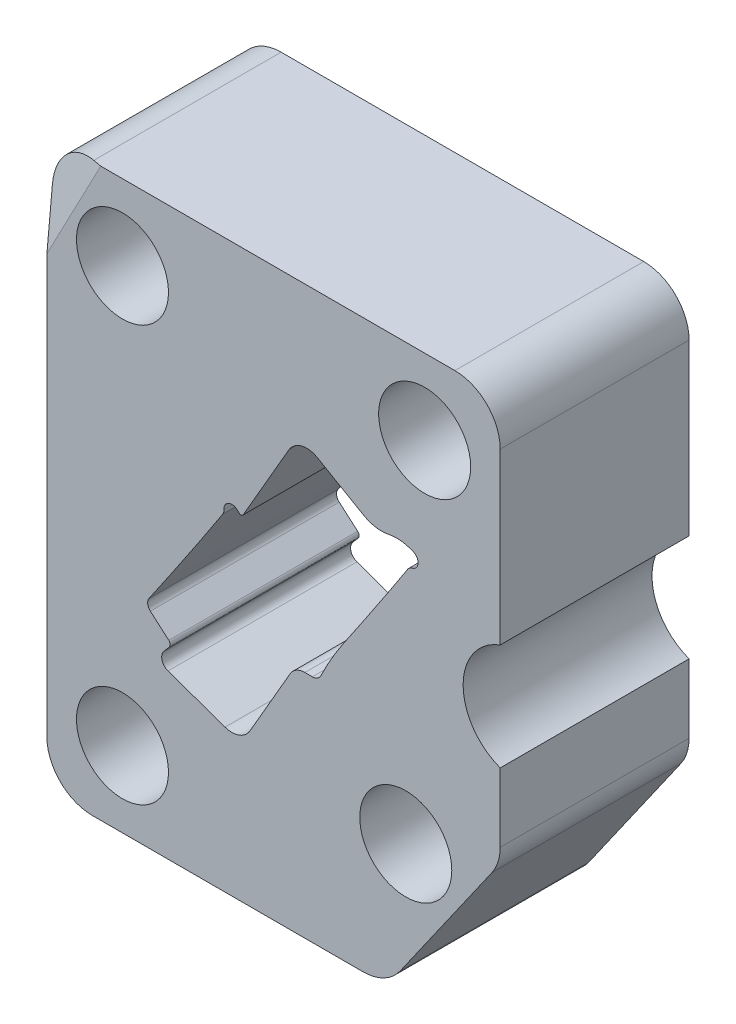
ISO-10303-21;
HEADER;
FILE_DESCRIPTION(('STEP AP214'),'2;1');
FILE_NAME('part.step','',(''),(''),'','','');
FILE_SCHEMA(('AUTOMOTIVE_DESIGN { 1 0 10303 214 1 1 1 1 }'));
ENDSEC;
DATA;
#1=APPLICATION_CONTEXT('core data for automotive mechanical design processes');
#2=APPLICATION_PROTOCOL_DEFINITION('international standard','automotive_design',2000,#1);
#3=PRODUCT_CONTEXT('',#1,'mechanical');
#4=PRODUCT('Part','Part','',(#3));
#5=PRODUCT_RELATED_PRODUCT_CATEGORY('part','',(#4));
#6=PRODUCT_DEFINITION_FORMATION('','',#4);
#7=PRODUCT_DEFINITION_CONTEXT('part definition',#1,'design');
#8=PRODUCT_DEFINITION('design','',#6,#7);
#9=PRODUCT_DEFINITION_SHAPE('','',#8);
#10=(LENGTH_UNIT() NAMED_UNIT(*) SI_UNIT(.MILLI.,.METRE.));
#11=(NAMED_UNIT(*) PLANE_ANGLE_UNIT() SI_UNIT($,.RADIAN.));
#12=(NAMED_UNIT(*) SI_UNIT($,.STERADIAN.) SOLID_ANGLE_UNIT());
#13=UNCERTAINTY_MEASURE_WITH_UNIT(LENGTH_MEASURE(1.E-05),#10,'distance_accuracy_value','');
#14=(GEOMETRIC_REPRESENTATION_CONTEXT(3) GLOBAL_UNCERTAINTY_ASSIGNED_CONTEXT((#13)) GLOBAL_UNIT_ASSIGNED_CONTEXT((#10,
#11,#12)) REPRESENTATION_CONTEXT('',''));
#15=CARTESIAN_POINT('',(0.,0.,0.));
#16=DIRECTION('',(0.,0.,1.));
#17=DIRECTION('',(1.,0.,0.));
#18=AXIS2_PLACEMENT_3D('',#15,#16,#17);
#19=CARTESIAN_POINT('',(-1047.75,51.435,-31.75));
#20=DIRECTION('',(1.,0.,0.));
#21=DIRECTION('',(0.,0.,-1.));
#22=AXIS2_PLACEMENT_3D('',#19,#20,#21);
#23=PLANE('',#22);
#24=DIRECTION('',(0.,0.,1.));
#25=VECTOR('',#24,1.);
#26=CARTESIAN_POINT('',(-1047.75,22.9178778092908,-31.75));
#27=LINE('',#26,#25);
#28=CARTESIAN_POINT('',(-1047.75,22.9178778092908,-31.75));
#29=VERTEX_POINT('',#28);
#30=CARTESIAN_POINT('',(-1047.75,22.9178778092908,0.));
#31=VERTEX_POINT('',#30);
#32=EDGE_CURVE('E762',#29,#31,#27,.T.);
#33=ORIENTED_EDGE('',*,*,#32,.F.);
#34=DIRECTION('',(0.,1.,0.));
#35=VECTOR('',#34,1.);
#36=CARTESIAN_POINT('',(-1047.75,51.435,-31.75));
#37=LINE('',#36,#35);
#38=CARTESIAN_POINT('',(-1047.75,51.435,-31.75));
#39=VERTEX_POINT('',#38);
#40=EDGE_CURVE('E877',#29,#39,#37,.T.);
#41=ORIENTED_EDGE('',*,*,#40,.T.);
#42=DIRECTION('',(0.,0.,1.));
#43=VECTOR('',#42,1.);
#44=CARTESIAN_POINT('',(-1047.75,51.435,-31.75));
#45=LINE('',#44,#43);
#46=CARTESIAN_POINT('',(-1047.75,51.435,0.));
#47=VERTEX_POINT('',#46);
#48=EDGE_CURVE('E833',#39,#47,#45,.T.);
#49=ORIENTED_EDGE('',*,*,#48,.T.);
#50=DIRECTION('',(0.,1.,0.));
#51=VECTOR('',#50,1.);
#52=CARTESIAN_POINT('',(-1047.75,51.435,0.));
#53=LINE('',#52,#51);
#54=EDGE_CURVE('E775',#31,#47,#53,.T.);
#55=ORIENTED_EDGE('',*,*,#54,.F.);
#56=EDGE_LOOP('',(#33,#41,#49,#55));
#57=FACE_BOUND('',#56,.T.);
#58=ADVANCED_FACE('F49',(#57),#23,.T.);
#59=CARTESIAN_POINT('',(-1055.37,-6.53371920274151,-31.75));
#60=DIRECTION('',(0.,0.,1.));
#61=DIRECTION('',(1.,0.,0.));
#62=AXIS2_PLACEMENT_3D('',#59,#60,#61);
#63=CYLINDRICAL_SURFACE('',#62,7.62000000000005);
#64=CARTESIAN_POINT('',(-1055.37,-6.53371920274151,0.));
#65=DIRECTION('',(0.,0.,1.));
#66=DIRECTION('',(-1.,0.,0.));
#67=AXIS2_PLACEMENT_3D('',#64,#65,#66);
#68=CIRCLE('',#67,7.62000000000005);
#69=CARTESIAN_POINT('',(-1049.12806142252,-10.9043716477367,0.));
#70=VERTEX_POINT('',#69);
#71=CARTESIAN_POINT('',(-1047.75,-6.53371920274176,0.));
#72=VERTEX_POINT('',#71);
#73=EDGE_CURVE('E772',#70,#72,#68,.T.);
#74=ORIENTED_EDGE('',*,*,#73,.F.);
#75=DIRECTION('',(0.,0.,1.));
#76=VECTOR('',#75,1.);
#77=CARTESIAN_POINT('',(-1049.12806142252,-10.9043716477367,-31.75));
#78=LINE('',#77,#76);
#79=CARTESIAN_POINT('',(-1049.12806142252,-10.9043716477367,-31.75));
#80=VERTEX_POINT('',#79);
#81=EDGE_CURVE('E58',#80,#70,#78,.T.);
#82=ORIENTED_EDGE('',*,*,#81,.F.);
#83=CARTESIAN_POINT('',(-1055.37,-6.53371920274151,-31.75));
#84=DIRECTION('',(0.,0.,1.));
#85=DIRECTION('',(-1.,0.,0.));
#86=AXIS2_PLACEMENT_3D('',#83,#84,#85);
#87=CIRCLE('',#86,7.62000000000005);
#88=CARTESIAN_POINT('',(-1047.75,-6.53371920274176,-31.75));
#89=VERTEX_POINT('',#88);
#90=EDGE_CURVE('E806',#80,#89,#87,.T.);
#91=ORIENTED_EDGE('',*,*,#90,.T.);
#92=DIRECTION('',(0.,0.,1.));
#93=VECTOR('',#92,1.);
#94=CARTESIAN_POINT('',(-1047.75,-6.53371920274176,-31.75));
#95=LINE('',#94,#93);
#96=EDGE_CURVE('E836',#89,#72,#95,.T.);
#97=ORIENTED_EDGE('',*,*,#96,.T.);
#98=EDGE_LOOP('',(#74,#82,#91,#97));
#99=FACE_BOUND('',#98,.T.);
#100=ADVANCED_FACE('F51',(#99),#63,.T.);
#101=CARTESIAN_POINT('',(-1064.56153238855,-32.945652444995,-31.75));
#102=DIRECTION('',(0.819152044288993,-0.573576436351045,0.));
#103=DIRECTION('',(0.573576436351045,0.819152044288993,0.));
#104=AXIS2_PLACEMENT_3D('',#101,#102,#103);
#105=PLANE('',#104);
#106=DIRECTION('',(0.573576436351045,0.819152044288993,0.));
#107=VECTOR('',#106,1.);
#108=CARTESIAN_POINT('',(-1064.56153238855,-32.945652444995,0.));
#109=LINE('',#108,#107);
#110=CARTESIAN_POINT('',(-1064.56153238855,-32.9456524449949,0.));
#111=VERTEX_POINT('',#110);
#112=EDGE_CURVE('E803',#111,#70,#109,.T.);
#113=ORIENTED_EDGE('',*,*,#112,.F.);
#114=DIRECTION('',(0.,0.,1.));
#115=VECTOR('',#114,1.);
#116=CARTESIAN_POINT('',(-1064.56153238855,-32.9456524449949,-31.75));
#117=LINE('',#116,#115);
#118=CARTESIAN_POINT('',(-1064.56153238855,-32.9456524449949,-31.75));
#119=VERTEX_POINT('',#118);
#120=EDGE_CURVE('E809',#119,#111,#117,.T.);
#121=ORIENTED_EDGE('',*,*,#120,.F.);
#122=DIRECTION('',(0.573576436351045,0.819152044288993,0.));
#123=VECTOR('',#122,1.);
#124=CARTESIAN_POINT('',(-1064.56153238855,-32.945652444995,-31.75));
#125=LINE('',#124,#123);
#126=EDGE_CURVE('E838',#119,#80,#125,.T.);
#127=ORIENTED_EDGE('',*,*,#126,.T.);
#128=ORIENTED_EDGE('',*,*,#81,.T.);
#129=EDGE_LOOP('',(#113,#121,#127,#128));
#130=FACE_BOUND('',#129,.T.);
#131=ADVANCED_FACE('F735',(#130),#105,.T.);
#132=CARTESIAN_POINT('',(-1070.80347096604,-28.575,-31.75));
#133=DIRECTION('',(0.,0.,1.));
#134=DIRECTION('',(1.,0.,0.));
#135=AXIS2_PLACEMENT_3D('',#132,#133,#134);
#136=CYLINDRICAL_SURFACE('',#135,7.62000000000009);
#137=CARTESIAN_POINT('',(-1070.80347096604,-28.575,0.));
#138=DIRECTION('',(0.,0.,1.));
#139=DIRECTION('',(-1.,0.,0.));
#140=AXIS2_PLACEMENT_3D('',#137,#138,#139);
#141=CIRCLE('',#140,7.62000000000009);
#142=CARTESIAN_POINT('',(-1070.80347096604,-36.195,0.));
#143=VERTEX_POINT('',#142);
#144=EDGE_CURVE('E799',#143,#111,#141,.T.);
#145=ORIENTED_EDGE('',*,*,#144,.F.);
#146=DIRECTION('',(0.,0.,1.));
#147=VECTOR('',#146,1.);
#148=CARTESIAN_POINT('',(-1070.80347096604,-36.195,-31.75));
#149=LINE('',#148,#147);
#150=CARTESIAN_POINT('',(-1070.80347096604,-36.195,-31.75));
#151=VERTEX_POINT('',#150);
#152=EDGE_CURVE('E812',#151,#143,#149,.T.);
#153=ORIENTED_EDGE('',*,*,#152,.F.);
#154=CARTESIAN_POINT('',(-1070.80347096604,-28.575,-31.75));
#155=DIRECTION('',(0.,0.,1.));
#156=DIRECTION('',(-1.,0.,0.));
#157=AXIS2_PLACEMENT_3D('',#154,#155,#156);
#158=CIRCLE('',#157,7.62000000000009);
#159=EDGE_CURVE('E843',#151,#119,#158,.T.);
#160=ORIENTED_EDGE('',*,*,#159,.T.);
#161=ORIENTED_EDGE('',*,*,#120,.T.);
#162=EDGE_LOOP('',(#145,#153,#160,#161));
#163=FACE_BOUND('',#162,.T.);
#164=ADVANCED_FACE('F943',(#163),#136,.T.);
#165=CARTESIAN_POINT('',(-1116.33,-36.195,-31.75));
#166=DIRECTION('',(0.,-1.,0.));
#167=DIRECTION('',(1.,0.,0.));
#168=AXIS2_PLACEMENT_3D('',#165,#166,#167);
#169=PLANE('',#168);
#170=DIRECTION('',(1.,0.,0.));
#171=VECTOR('',#170,1.);
#172=CARTESIAN_POINT('',(-1116.33,-36.195,0.));
#173=LINE('',#172,#171);
#174=CARTESIAN_POINT('',(-1116.33,-36.195,0.));
#175=VERTEX_POINT('',#174);
#176=EDGE_CURVE('E795',#175,#143,#173,.T.);
#177=ORIENTED_EDGE('',*,*,#176,.F.);
#178=DIRECTION('',(0.,0.,1.));
#179=VECTOR('',#178,1.);
#180=CARTESIAN_POINT('',(-1116.33,-36.195,-31.75));
#181=LINE('',#180,#179);
#182=CARTESIAN_POINT('',(-1116.33,-36.195,-31.75));
#183=VERTEX_POINT('',#182);
#184=EDGE_CURVE('E815',#183,#175,#181,.T.);
#185=ORIENTED_EDGE('',*,*,#184,.F.);
#186=DIRECTION('',(1.,0.,0.));
#187=VECTOR('',#186,1.);
#188=CARTESIAN_POINT('',(-1116.33,-36.195,-31.75));
#189=LINE('',#188,#187);
#190=EDGE_CURVE('E849',#183,#151,#189,.T.);
#191=ORIENTED_EDGE('',*,*,#190,.T.);
#192=ORIENTED_EDGE('',*,*,#152,.T.);
#193=EDGE_LOOP('',(#177,#185,#191,#192));
#194=FACE_BOUND('',#193,.T.);
#195=ADVANCED_FACE('F946',(#194),#169,.T.);
#196=CARTESIAN_POINT('',(-1116.33,-28.575,-31.75));
#197=DIRECTION('',(0.,0.,1.));
#198=DIRECTION('',(1.,0.,0.));
#199=AXIS2_PLACEMENT_3D('',#196,#197,#198);
#200=CYLINDRICAL_SURFACE('',#199,7.61999999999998);
#201=CARTESIAN_POINT('',(-1116.33,-28.575,0.));
#202=DIRECTION('',(0.,0.,1.));
#203=DIRECTION('',(1.,0.,0.));
#204=AXIS2_PLACEMENT_3D('',#201,#202,#203);
#205=CIRCLE('',#204,7.61999999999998);
#206=CARTESIAN_POINT('',(-1123.95,-28.5749999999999,0.));
#207=VERTEX_POINT('',#206);
#208=EDGE_CURVE('E791',#207,#175,#205,.T.);
#209=ORIENTED_EDGE('',*,*,#208,.F.);
#210=DIRECTION('',(0.,0.,1.));
#211=VECTOR('',#210,1.);
#212=CARTESIAN_POINT('',(-1123.95,-28.5749999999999,-31.75));
#213=LINE('',#212,#211);
#214=CARTESIAN_POINT('',(-1123.95,-28.5749999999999,-31.75));
#215=VERTEX_POINT('',#214);
#216=EDGE_CURVE('E818',#215,#207,#213,.T.);
#217=ORIENTED_EDGE('',*,*,#216,.F.);
#218=CARTESIAN_POINT('',(-1116.33,-28.575,-31.75));
#219=DIRECTION('',(0.,0.,1.));
#220=DIRECTION('',(1.,0.,0.));
#221=AXIS2_PLACEMENT_3D('',#218,#219,#220);
#222=CIRCLE('',#221,7.61999999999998);
#223=EDGE_CURVE('E855',#215,#183,#222,.T.);
#224=ORIENTED_EDGE('',*,*,#223,.T.);
#225=ORIENTED_EDGE('',*,*,#184,.T.);
#226=EDGE_LOOP('',(#209,#217,#224,#225));
#227=FACE_BOUND('',#226,.T.);
#228=ADVANCED_FACE('F950',(#227),#200,.T.);
#229=CARTESIAN_POINT('',(-1123.95,51.435,-31.75));
#230=DIRECTION('',(-1.,0.,0.));
#231=DIRECTION('',(0.,0.,1.));
#232=AXIS2_PLACEMENT_3D('',#229,#230,#231);
#233=PLANE('',#232);
#234=DIRECTION('',(0.,-0.995485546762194,0.0949132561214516));
#235=VECTOR('',#234,1.);
#236=CARTESIAN_POINT('',(-1123.95,54.348127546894,-1.19603433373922));
#237=LINE('',#236,#235);
#238=CARTESIAN_POINT('',(-1123.95,51.435,-0.918286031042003));
#239=VERTEX_POINT('',#238);
#240=CARTESIAN_POINT('',(-1123.95,41.8036744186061,0.));
#241=VERTEX_POINT('',#240);
#242=EDGE_CURVE('E884',#239,#241,#237,.T.);
#243=ORIENTED_EDGE('',*,*,#242,.F.);
#244=DIRECTION('',(0.,0.,1.));
#245=VECTOR('',#244,1.);
#246=CARTESIAN_POINT('',(-1123.95,51.435,-31.75));
#247=LINE('',#246,#245);
#248=CARTESIAN_POINT('',(-1123.95,51.435,-31.75));
#249=VERTEX_POINT('',#248);
#250=EDGE_CURVE('E822',#249,#239,#247,.T.);
#251=ORIENTED_EDGE('',*,*,#250,.F.);
#252=DIRECTION('',(0.,-1.,0.));
#253=VECTOR('',#252,1.);
#254=CARTESIAN_POINT('',(-1123.95,51.435,-31.75));
#255=LINE('',#254,#253);
#256=EDGE_CURVE('E859',#249,#215,#255,.T.);
#257=ORIENTED_EDGE('',*,*,#256,.T.);
#258=ORIENTED_EDGE('',*,*,#216,.T.);
#259=DIRECTION('',(0.,-1.,0.));
#260=VECTOR('',#259,1.);
#261=CARTESIAN_POINT('',(-1123.95,51.435,0.));
#262=LINE('',#261,#260);
#263=EDGE_CURVE('E788',#241,#207,#262,.T.);
#264=ORIENTED_EDGE('',*,*,#263,.F.);
#265=EDGE_LOOP('',(#243,#251,#257,#258,#264));
#266=FACE_BOUND('',#265,.T.);
#267=ADVANCED_FACE('F954',(#266),#233,.T.);
#268=CARTESIAN_POINT('',(-1116.33,51.435,-31.75));
#269=DIRECTION('',(0.,0.,1.));
#270=DIRECTION('',(1.,0.,0.));
#271=AXIS2_PLACEMENT_3D('',#268,#269,#270);
#272=CYLINDRICAL_SURFACE('',#271,7.61999999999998);
#273=CARTESIAN_POINT('',(-1116.33,51.435,0.46716851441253));
#274=DIRECTION('',(0.178103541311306,-0.0933957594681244,-0.97956947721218));
#275=DIRECTION('',(0.867526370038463,-0.454922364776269,0.201106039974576));
#276=AXIS2_PLACEMENT_3D('',#273,#274,#275);
#277=ELLIPSE('',#276,7.77892755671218,7.61999999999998);
#278=CARTESIAN_POINT('',(-1116.33,59.055,-0.259350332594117));
#279=VERTEX_POINT('',#278);
#280=EDGE_CURVE('E888',#279,#239,#277,.F.);
#281=ORIENTED_EDGE('',*,*,#280,.F.);
#282=DIRECTION('',(0.,0.,1.));
#283=VECTOR('',#282,1.);
#284=CARTESIAN_POINT('',(-1116.33,59.055,-31.75));
#285=LINE('',#284,#283);
#286=CARTESIAN_POINT('',(-1116.33,59.055,-31.75));
#287=VERTEX_POINT('',#286);
#288=EDGE_CURVE('E826',#287,#279,#285,.T.);
#289=ORIENTED_EDGE('',*,*,#288,.F.);
#290=CARTESIAN_POINT('',(-1116.33,51.435,-31.75));
#291=DIRECTION('',(0.,0.,1.));
#292=DIRECTION('',(1.,0.,0.));
#293=AXIS2_PLACEMENT_3D('',#290,#291,#292);
#294=CIRCLE('',#293,7.61999999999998);
#295=EDGE_CURVE('E863',#287,#249,#294,.T.);
#296=ORIENTED_EDGE('',*,*,#295,.T.);
#297=ORIENTED_EDGE('',*,*,#250,.T.);
#298=EDGE_LOOP('',(#281,#289,#296,#297));
#299=FACE_BOUND('',#298,.T.);
#300=ADVANCED_FACE('F901',(#299),#272,.T.);
#301=CARTESIAN_POINT('',(-1116.33,59.055,-31.75));
#302=DIRECTION('',(0.,1.,0.));
#303=DIRECTION('',(-1.,0.,0.));
#304=AXIS2_PLACEMENT_3D('',#301,#302,#303);
#305=PLANE('',#304);
#306=DIRECTION('',(-0.983869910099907,0.,-0.178885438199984));
#307=VECTOR('',#306,1.);
#308=CARTESIAN_POINT('',(-1121.87235434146,59.055,-1.26705112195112));
#309=LINE('',#308,#307);
#310=CARTESIAN_POINT('',(-1114.90357317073,59.055,0.));
#311=VERTEX_POINT('',#310);
#312=EDGE_CURVE('E618',#311,#279,#309,.T.);
#313=ORIENTED_EDGE('',*,*,#312,.F.);
#314=DIRECTION('',(-1.,0.,0.));
#315=VECTOR('',#314,1.);
#316=CARTESIAN_POINT('',(-1116.33,59.055,0.));
#317=LINE('',#316,#315);
#318=CARTESIAN_POINT('',(-1055.37,59.055,0.));
#319=VERTEX_POINT('',#318);
#320=EDGE_CURVE('E781',#319,#311,#317,.T.);
#321=ORIENTED_EDGE('',*,*,#320,.F.);
#322=DIRECTION('',(0.,0.,1.));
#323=VECTOR('',#322,1.);
#324=CARTESIAN_POINT('',(-1055.37,59.055,-31.75));
#325=LINE('',#324,#323);
#326=CARTESIAN_POINT('',(-1055.37,59.055,-31.75));
#327=VERTEX_POINT('',#326);
#328=EDGE_CURVE('E830',#327,#319,#325,.T.);
#329=ORIENTED_EDGE('',*,*,#328,.F.);
#330=DIRECTION('',(-1.,0.,0.));
#331=VECTOR('',#330,1.);
#332=CARTESIAN_POINT('',(-1116.33,59.055,-31.75));
#333=LINE('',#332,#331);
#334=EDGE_CURVE('E867',#327,#287,#333,.T.);
#335=ORIENTED_EDGE('',*,*,#334,.T.);
#336=ORIENTED_EDGE('',*,*,#288,.T.);
#337=EDGE_LOOP('',(#313,#321,#329,#335,#336));
#338=FACE_BOUND('',#337,.T.);
#339=ADVANCED_FACE('F748',(#338),#305,.T.);
#340=CARTESIAN_POINT('',(-1055.37,51.435,-31.75));
#341=DIRECTION('',(0.,0.,1.));
#342=DIRECTION('',(1.,0.,0.));
#343=AXIS2_PLACEMENT_3D('',#340,#341,#342);
#344=CYLINDRICAL_SURFACE('',#343,7.61999999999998);
#345=CARTESIAN_POINT('',(-1055.37,51.435,0.));
#346=DIRECTION('',(0.,0.,1.));
#347=DIRECTION('',(-1.,0.,0.));
#348=AXIS2_PLACEMENT_3D('',#345,#346,#347);
#349=CIRCLE('',#348,7.61999999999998);
#350=EDGE_CURVE('E774',#47,#319,#349,.T.);
#351=ORIENTED_EDGE('',*,*,#350,.F.);
#352=ORIENTED_EDGE('',*,*,#48,.F.);
#353=CARTESIAN_POINT('',(-1055.37,51.435,-31.75));
#354=DIRECTION('',(0.,0.,1.));
#355=DIRECTION('',(-1.,0.,0.));
#356=AXIS2_PLACEMENT_3D('',#353,#354,#355);
#357=CIRCLE('',#356,7.61999999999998);
#358=EDGE_CURVE('E871',#39,#327,#357,.T.);
#359=ORIENTED_EDGE('',*,*,#358,.T.);
#360=ORIENTED_EDGE('',*,*,#328,.T.);
#361=EDGE_LOOP('',(#351,#352,#359,#360));
#362=FACE_BOUND('',#361,.T.);
#363=ADVANCED_FACE('F740',(#362),#344,.T.);
#364=DIRECTION('',(0.,0.,1.));
#365=VECTOR('',#364,1.);
#366=CARTESIAN_POINT('',(-1047.75,5.02212219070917,-31.75));
#367=LINE('',#366,#365);
#368=CARTESIAN_POINT('',(-1047.75,5.02212219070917,0.));
#369=VERTEX_POINT('',#368);
#370=CARTESIAN_POINT('',(-1047.75,5.02212219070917,-31.75));
#371=VERTEX_POINT('',#370);
#372=EDGE_CURVE('E753',#369,#371,#367,.F.);
#373=ORIENTED_EDGE('',*,*,#372,.F.);
#374=EDGE_CURVE('E755',#72,#369,#53,.T.);
#375=ORIENTED_EDGE('',*,*,#374,.F.);
#376=ORIENTED_EDGE('',*,*,#96,.F.);
#377=EDGE_CURVE('E758',#89,#371,#37,.T.);
#378=ORIENTED_EDGE('',*,*,#377,.T.);
#379=EDGE_LOOP('',(#373,#375,#376,#378));
#380=FACE_BOUND('',#379,.T.);
#381=ADVANCED_FACE('F729',(#380),#23,.T.);
#382=CARTESIAN_POINT('',(-1055.37,-6.53371920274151,-31.75));
#383=DIRECTION('',(0.,0.,-1.));
#384=DIRECTION('',(-1.,0.,0.));
#385=AXIS2_PLACEMENT_3D('',#382,#383,#384);
#386=PLANE('',#385);
#387=CARTESIAN_POINT('',(-1080.59610530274,-0.363947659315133,-31.75));
#388=DIRECTION('',(0.,0.,-1.));
#389=DIRECTION('',(1.,0.,0.));
#390=AXIS2_PLACEMENT_3D('',#387,#388,#389);
#391=CIRCLE('',#390,2.85496000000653);
#392=CARTESIAN_POINT('',(-1083.06857318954,1.06353234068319,-31.75));
#393=VERTEX_POINT('',#392);
#394=CARTESIAN_POINT('',(-1080.59610530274,2.49101234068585,-31.75));
#395=VERTEX_POINT('',#394);
#396=EDGE_CURVE('E418',#393,#395,#391,.T.);
#397=ORIENTED_EDGE('',*,*,#396,.T.);
#398=DIRECTION('',(1.,0.,0.));
#399=VECTOR('',#398,1.);
#400=CARTESIAN_POINT('',(-1080.59610530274,2.49101234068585,-31.75));
#401=LINE('',#400,#399);
#402=CARTESIAN_POINT('',(-1079.32610530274,2.49101234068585,-31.75));
#403=VERTEX_POINT('',#402);
#404=EDGE_CURVE('E422',#395,#403,#401,.T.);
#405=ORIENTED_EDGE('',*,*,#404,.T.);
#406=CARTESIAN_POINT('',(-1079.32610530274,4.08105234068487,-31.75));
#407=DIRECTION('',(0.,0.,1.));
#408=DIRECTION('',(1.,0.,0.));
#409=AXIS2_PLACEMENT_3D('',#406,#407,#408);
#410=CIRCLE('',#409,1.59003999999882);
#411=CARTESIAN_POINT('',(-1077.89595639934,3.38614132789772,-31.75));
#412=VERTEX_POINT('',#411);
#413=EDGE_CURVE('E65',#403,#412,#410,.T.);
#414=ORIENTED_EDGE('',*,*,#413,.T.);
#415=CARTESIAN_POINT('',(-1030.09012737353,-19.8427665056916,-31.75));
#416=DIRECTION('',(0.,0.,-1.));
#417=DIRECTION('',(1.,0.,0.));
#418=AXIS2_PLACEMENT_3D('',#415,#416,#417);
#419=CIRCLE('',#418,53.1505357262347);
#420=CARTESIAN_POINT('',(-1074.18596951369,9.8310629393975,-31.75));
#421=VERTEX_POINT('',#420);
#422=EDGE_CURVE('E427',#412,#421,#419,.T.);
#423=ORIENTED_EDGE('',*,*,#422,.T.);
#424=CARTESIAN_POINT('',(-1773.16946147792,487.596028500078,-31.75));
#425=DIRECTION('',(0.,0.,1.));
#426=DIRECTION('',(1.,0.,0.));
#427=AXIS2_PLACEMENT_3D('',#424,#425,#426);
#428=CIRCLE('',#427,846.662438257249);
#429=CARTESIAN_POINT('',(-1063.27939783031,26.1923203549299,-31.75));
#430=VERTEX_POINT('',#429);
#431=EDGE_CURVE('E431',#421,#430,#428,.T.);
#432=ORIENTED_EDGE('',*,*,#431,.T.);
#433=CARTESIAN_POINT('',(-1062.26992911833,25.5362010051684,-31.75));
#434=DIRECTION('',(0.,0.,-1.));
#435=DIRECTION('',(1.,0.,0.));
#436=AXIS2_PLACEMENT_3D('',#433,#434,#435);
#437=CIRCLE('',#436,1.20395999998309);
#438=CARTESIAN_POINT('',(-1062.55904643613,26.704931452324,-31.75));
#439=VERTEX_POINT('',#438);
#440=EDGE_CURVE('E435',#430,#439,#437,.T.);
#441=ORIENTED_EDGE('',*,*,#440,.T.);
#442=CARTESIAN_POINT('',(-1062.8760390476,27.9863452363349,-31.75));
#443=DIRECTION('',(0.,0.,1.));
#444=DIRECTION('',(1.,0.,0.));
#445=AXIS2_PLACEMENT_3D('',#442,#443,#444);
#446=CIRCLE('',#445,1.32004000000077);
#447=CARTESIAN_POINT('',(-1062.43722912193,29.2313156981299,-31.75));
#448=VERTEX_POINT('',#447);
#449=EDGE_CURVE('E439',#439,#448,#446,.T.);
#450=ORIENTED_EDGE('',*,*,#449,.T.);
#451=DIRECTION('',(-0.943130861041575,0.332421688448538,0.));
#452=VECTOR('',#451,1.);
#453=CARTESIAN_POINT('',(-1062.43722912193,29.2313156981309,-31.75));
#454=LINE('',#453,#452);
#455=CARTESIAN_POINT('',(-1062.91633959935,29.400185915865,-31.75));
#456=VERTEX_POINT('',#455);
#457=EDGE_CURVE('E443',#448,#456,#454,.T.);
#458=ORIENTED_EDGE('',*,*,#457,.T.);
#459=CARTESIAN_POINT('',(-1065.13360555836,23.109465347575,-31.75));
#460=DIRECTION('',(0.,0.,1.));
#461=DIRECTION('',(1.,0.,0.));
#462=AXIS2_PLACEMENT_3D('',#459,#460,#461);
#463=CIRCLE('',#462,6.67003999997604);
#464=CARTESIAN_POINT('',(-1066.47629226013,29.6429656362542,-31.75));
#465=VERTEX_POINT('',#464);
#466=EDGE_CURVE('E447',#456,#465,#463,.T.);
#467=ORIENTED_EDGE('',*,*,#466,.T.);
#468=CARTESIAN_POINT('',(-1067.69013012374,35.5494887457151,-31.75));
#469=DIRECTION('',(0.,0.,-1.));
#470=DIRECTION('',(1.,0.,0.));
#471=AXIS2_PLACEMENT_3D('',#468,#469,#470);
#472=CIRCLE('',#471,6.02996000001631);
#473=CARTESIAN_POINT('',(-1070.70511012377,30.3273902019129,-31.75));
#474=VERTEX_POINT('',#473);
#475=EDGE_CURVE('E451',#465,#474,#472,.T.);
#476=ORIENTED_EDGE('',*,*,#475,.T.);
#477=DIRECTION('',(-0.866025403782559,0.500000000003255,0.));
#478=VECTOR('',#477,1.);
#479=CARTESIAN_POINT('',(-1070.70511012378,30.3273902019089,-31.75));
#480=LINE('',#479,#478);
#481=CARTESIAN_POINT('',(-1078.50923469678,34.8331036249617,-31.75));
#482=VERTEX_POINT('',#481);
#483=EDGE_CURVE('E455',#474,#482,#480,.T.);
#484=ORIENTED_EDGE('',*,*,#483,.T.);
#485=CARTESIAN_POINT('',(-1080.25675469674,31.806310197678,-31.75));
#486=DIRECTION('',(0.,0.,1.));
#487=DIRECTION('',(1.,0.,0.));
#488=AXIS2_PLACEMENT_3D('',#485,#486,#487);
#489=CIRCLE('',#488,3.49504000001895);
#490=CARTESIAN_POINT('',(-1083.28354812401,33.5538301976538,-31.75));
#491=VERTEX_POINT('',#490);
#492=EDGE_CURVE('E459',#482,#491,#489,.T.);
#493=ORIENTED_EDGE('',*,*,#492,.T.);
#494=DIRECTION('',(-0.500000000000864,-0.86602540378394,0.));
#495=VECTOR('',#494,1.);
#496=CARTESIAN_POINT('',(-1083.28354812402,33.5538301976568,-31.75));
#497=LINE('',#496,#495);
#498=CARTESIAN_POINT('',(-1090.9446676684,20.2843819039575,-31.75));
#499=VERTEX_POINT('',#498);
#500=EDGE_CURVE('E463',#491,#499,#497,.T.);
#501=ORIENTED_EDGE('',*,*,#500,.T.);
#502=CARTESIAN_POINT('',(-1091.32741625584,20.5053619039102,-31.75));
#503=DIRECTION('',(0.,0.,-1.));
#504=DIRECTION('',(1.,0.,0.));
#505=AXIS2_PLACEMENT_3D('',#502,#503,#504);
#506=CIRCLE('',#505,0.441959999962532);
#507=CARTESIAN_POINT('',(-1091.61806500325,20.1724175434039,-31.75));
#508=VERTEX_POINT('',#507);
#509=EDGE_CURVE('E467',#499,#508,#506,.T.);
#510=ORIENTED_EDGE('',*,*,#509,.T.);
#511=DIRECTION('',(-0.753335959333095,0.657635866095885,0.));
#512=VECTOR('',#511,1.);
#513=CARTESIAN_POINT('',(-1091.61806500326,20.1724175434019,-31.75));
#514=LINE('',#513,#512);
#515=CARTESIAN_POINT('',(-1092.00075967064,20.5064965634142,-31.75));
#516=VERTEX_POINT('',#515);
#517=EDGE_CURVE('E471',#508,#516,#514,.T.);
#518=ORIENTED_EDGE('',*,*,#517,.T.);
#519=CARTESIAN_POINT('',(-1092.86886531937,19.5120629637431,-31.75));
#520=DIRECTION('',(0.,0.,1.));
#521=DIRECTION('',(1.,0.,0.));
#522=AXIS2_PLACEMENT_3D('',#519,#520,#521);
#523=CIRCLE('',#522,1.3200399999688);
#524=CARTESIAN_POINT('',(-1094.18511698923,19.4121272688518,-31.75));
#525=VERTEX_POINT('',#524);
#526=EDGE_CURVE('E475',#516,#525,#523,.T.);
#527=ORIENTED_EDGE('',*,*,#526,.T.);
#528=CARTESIAN_POINT('',(-1095.38562179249,19.3209795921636,-31.75));
#529=DIRECTION('',(0.,0.,-1.));
#530=DIRECTION('',(1.,0.,0.));
#531=AXIS2_PLACEMENT_3D('',#528,#529,#530);
#532=CIRCLE('',#531,1.20396000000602);
#533=CARTESIAN_POINT('',(-1094.37737634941,18.6629820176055,-31.75));
#534=VERTEX_POINT('',#533);
#535=EDGE_CURVE('E479',#525,#534,#532,.T.);
#536=ORIENTED_EDGE('',*,*,#535,.T.);
#537=CARTESIAN_POINT('',(-1812.92046147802,487.596028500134,-31.75));
#538=DIRECTION('',(0.,0.,-1.));
#539=DIRECTION('',(1.,0.,0.));
#540=AXIS2_PLACEMENT_3D('',#537,#538,#539);
#541=CIRCLE('',#540,858.022358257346);
#542=CARTESIAN_POINT('',(-1106.78457847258,0.179900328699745,-31.75));
#543=VERTEX_POINT('',#542);
#544=EDGE_CURVE('E483',#534,#543,#541,.T.);
#545=ORIENTED_EDGE('',*,*,#544,.T.);
#546=CARTESIAN_POINT('',(-1105.69821096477,-0.569973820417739,-31.75));
#547=DIRECTION('',(0.,0.,1.));
#548=DIRECTION('',(1.,0.,0.));
#549=AXIS2_PLACEMENT_3D('',#546,#547,#548);
#550=CIRCLE('',#549,1.32003999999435);
#551=CARTESIAN_POINT('',(-1106.56374816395,-1.5666437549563,-31.75));
#552=VERTEX_POINT('',#551);
#553=EDGE_CURVE('E487',#543,#552,#550,.T.);
#554=ORIENTED_EDGE('',*,*,#553,.T.);
#555=DIRECTION('',(0.755030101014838,-0.655690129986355,0.));
#556=VECTOR('',#555,1.);
#557=CARTESIAN_POINT('',(-1106.56374816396,-1.56664375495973,-31.75));
#558=LINE('',#557,#556);
#559=CARTESIAN_POINT('',(-1103.46346744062,-4.25901783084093,-31.75));
#560=VERTEX_POINT('',#559);
#561=EDGE_CURVE('E491',#552,#560,#558,.T.);
#562=ORIENTED_EDGE('',*,*,#561,.T.);
#563=CARTESIAN_POINT('',(-1103.91980154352,-4.78448857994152,-31.75));
#564=DIRECTION('',(0.,0.,-1.));
#565=DIRECTION('',(1.,0.,0.));
#566=AXIS2_PLACEMENT_3D('',#563,#564,#565);
#567=CIRCLE('',#566,0.69596000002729);
#568=CARTESIAN_POINT('',(-1103.39433079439,-5.24082268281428,-31.75));
#569=VERTEX_POINT('',#568);
#570=EDGE_CURVE('E495',#560,#569,#567,.T.);
#571=ORIENTED_EDGE('',*,*,#570,.T.);
#572=DIRECTION('',(-0.655690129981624,-0.755030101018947,0.));
#573=VECTOR('',#572,1.);
#574=CARTESIAN_POINT('',(-1103.39433079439,-5.24082268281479,-31.75));
#575=LINE('',#574,#573);
#576=CARTESIAN_POINT('',(-1104.26427726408,-6.24256991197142,-31.75));
#577=VERTEX_POINT('',#576);
#578=EDGE_CURVE('E499',#569,#577,#575,.T.);
#579=ORIENTED_EDGE('',*,*,#578,.T.);
#580=CARTESIAN_POINT('',(-1103.06374920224,-7.28514344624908,-31.75));
#581=DIRECTION('',(0.,0.,1.));
#582=DIRECTION('',(1.,0.,0.));
#583=AXIS2_PLACEMENT_3D('',#580,#581,#582);
#584=CIRCLE('',#583,1.59004000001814);
#585=CARTESIAN_POINT('',(-1103.59231298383,-8.78475924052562,-31.75));
#586=VERTEX_POINT('',#585);
#587=EDGE_CURVE('E503',#577,#586,#584,.T.);
#588=ORIENTED_EDGE('',*,*,#587,.T.);
#589=DIRECTION('',(0.943130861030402,-0.332421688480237,0.));
#590=VECTOR('',#589,1.);
#591=CARTESIAN_POINT('',(-1103.59231298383,-8.78475924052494,-31.75));
#592=LINE('',#591,#590);
#593=CARTESIAN_POINT('',(-1094.00077423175,-12.1654518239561,-31.75));
#594=VERTEX_POINT('',#593);
#595=EDGE_CURVE('E507',#586,#594,#592,.T.);
#596=ORIENTED_EDGE('',*,*,#595,.T.);
#597=CARTESIAN_POINT('',(-1092.83894713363,-8.86917173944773,-31.75));
#598=DIRECTION('',(0.,0.,1.));
#599=DIRECTION('',(1.,0.,0.));
#600=AXIS2_PLACEMENT_3D('',#597,#598,#599);
#601=CIRCLE('',#600,3.49503999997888);
#602=CARTESIAN_POINT('',(-1089.8121537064,-10.6166917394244,-31.75));
#603=VERTEX_POINT('',#602);
#604=EDGE_CURVE('E511',#594,#603,#601,.T.);
#605=ORIENTED_EDGE('',*,*,#604,.T.);
#606=DIRECTION('',(0.500000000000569,0.86602540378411,0.));
#607=VECTOR('',#606,1.);
#608=CARTESIAN_POINT('',(-1089.8121537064,-10.6166917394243,-31.75));
#609=LINE('',#608,#607);
#610=EDGE_CURVE('E515',#603,#393,#609,.T.);
#611=ORIENTED_EDGE('',*,*,#610,.T.);
#612=EDGE_LOOP('',(#397,#405,#414,#423,#432,#441,#450,#458,#467,#476,#484,#493,#501,#510,#518,
#527,#536,#545,#554,#562,#571,#579,#588,#596,#605,#611));
#613=FACE_BOUND('',#612,.T.);
#614=CARTESIAN_POINT('',(-1111.25,-23.495,-31.75));
#615=DIRECTION('',(0.,0.,1.));
#616=DIRECTION('',(1.,0.,0.));
#617=AXIS2_PLACEMENT_3D('',#614,#615,#616);
#618=CIRCLE('',#617,5.15620000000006);
#619=CARTESIAN_POINT('',(-1106.0938,-23.495,-31.75));
#620=VERTEX_POINT('',#619);
#621=EDGE_CURVE('E522',#620,#620,#618,.T.);
#622=ORIENTED_EDGE('',*,*,#621,.T.);
#623=EDGE_LOOP('',(#622));
#624=FACE_BOUND('',#623,.T.);
#625=CARTESIAN_POINT('',(-1063.625,-13.97,-31.75));
#626=DIRECTION('',(0.,0.,1.));
#627=DIRECTION('',(1.,0.,0.));
#628=AXIS2_PLACEMENT_3D('',#625,#626,#627);
#629=CIRCLE('',#628,5.15620000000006);
#630=CARTESIAN_POINT('',(-1058.4688,-13.97,-31.75));
#631=VERTEX_POINT('',#630);
#632=EDGE_CURVE('E686',#631,#631,#629,.T.);
#633=ORIENTED_EDGE('',*,*,#632,.T.);
#634=EDGE_LOOP('',(#633));
#635=FACE_BOUND('',#634,.T.);
#636=CARTESIAN_POINT('',(-1060.45,46.355,-31.75));
#637=DIRECTION('',(0.,0.,1.));
#638=DIRECTION('',(1.,0.,0.));
#639=AXIS2_PLACEMENT_3D('',#636,#637,#638);
#640=CIRCLE('',#639,5.15620000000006);
#641=CARTESIAN_POINT('',(-1055.2938,46.355,-31.75));
#642=VERTEX_POINT('',#641);
#643=EDGE_CURVE('E661',#642,#642,#640,.T.);
#644=ORIENTED_EDGE('',*,*,#643,.T.);
#645=EDGE_LOOP('',(#644));
#646=FACE_BOUND('',#645,.T.);
#647=CARTESIAN_POINT('',(-1111.25,46.355,-31.75));
#648=DIRECTION('',(0.,0.,1.));
#649=DIRECTION('',(1.,0.,0.));
#650=AXIS2_PLACEMENT_3D('',#647,#648,#649);
#651=CIRCLE('',#650,5.15620000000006);
#652=CARTESIAN_POINT('',(-1106.0938,46.355,-31.75));
#653=VERTEX_POINT('',#652);
#654=EDGE_CURVE('E634',#653,#653,#651,.T.);
#655=ORIENTED_EDGE('',*,*,#654,.T.);
#656=EDGE_LOOP('',(#655));
#657=FACE_BOUND('',#656,.T.);
#658=CARTESIAN_POINT('',(-1044.448,13.97,-31.75));
#659=DIRECTION('',(0.,0.,1.));
#660=DIRECTION('',(1.,0.,0.));
#661=AXIS2_PLACEMENT_3D('',#658,#659,#660);
#662=CIRCLE('',#661,9.5377);
#663=EDGE_CURVE('E763',#29,#371,#662,.T.);
#664=ORIENTED_EDGE('',*,*,#663,.T.);
#665=ORIENTED_EDGE('',*,*,#377,.F.);
#666=ORIENTED_EDGE('',*,*,#90,.F.);
#667=ORIENTED_EDGE('',*,*,#126,.F.);
#668=ORIENTED_EDGE('',*,*,#159,.F.);
#669=ORIENTED_EDGE('',*,*,#190,.F.);
#670=ORIENTED_EDGE('',*,*,#223,.F.);
#671=ORIENTED_EDGE('',*,*,#256,.F.);
#672=ORIENTED_EDGE('',*,*,#295,.F.);
#673=ORIENTED_EDGE('',*,*,#334,.F.);
#674=ORIENTED_EDGE('',*,*,#358,.F.);
#675=ORIENTED_EDGE('',*,*,#40,.F.);
#676=EDGE_LOOP('',(#664,#665,#666,#667,#668,#669,#670,#671,#672,#673,#674,#675));
#677=FACE_BOUND('',#676,.T.);
#678=ADVANCED_FACE('F739',(#613,#624,#635,#646,#657,#677),#386,.T.);
#679=CARTESIAN_POINT('',(-1055.37,-6.53371920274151,0.));
#680=DIRECTION('',(0.,0.,-1.));
#681=DIRECTION('',(-1.,0.,0.));
#682=AXIS2_PLACEMENT_3D('',#679,#680,#681);
#683=PLANE('',#682);
#684=DIRECTION('',(1.,0.,0.));
#685=VECTOR('',#684,1.);
#686=CARTESIAN_POINT('',(-1080.59610530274,2.49101234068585,0.));
#687=LINE('',#686,#685);
#688=CARTESIAN_POINT('',(-1080.59610530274,2.49101234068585,0.));
#689=VERTEX_POINT('',#688);
#690=CARTESIAN_POINT('',(-1079.32610530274,2.49101234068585,0.));
#691=VERTEX_POINT('',#690);
#692=EDGE_CURVE('E313',#689,#691,#687,.T.);
#693=ORIENTED_EDGE('',*,*,#692,.F.);
#694=CARTESIAN_POINT('',(-1080.59610530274,-0.363947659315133,0.));
#695=DIRECTION('',(0.,0.,-1.));
#696=DIRECTION('',(1.,0.,0.));
#697=AXIS2_PLACEMENT_3D('',#694,#695,#696);
#698=CIRCLE('',#697,2.85496000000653);
#699=CARTESIAN_POINT('',(-1083.06857318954,1.06353234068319,0.));
#700=VERTEX_POINT('',#699);
#701=EDGE_CURVE('E73',#700,#689,#698,.T.);
#702=ORIENTED_EDGE('',*,*,#701,.F.);
#703=DIRECTION('',(0.500000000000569,0.86602540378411,0.));
#704=VECTOR('',#703,1.);
#705=CARTESIAN_POINT('',(-1089.8121537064,-10.6166917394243,0.));
#706=LINE('',#705,#704);
#707=CARTESIAN_POINT('',(-1089.8121537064,-10.6166917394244,0.));
#708=VERTEX_POINT('',#707);
#709=EDGE_CURVE('E414',#708,#700,#706,.T.);
#710=ORIENTED_EDGE('',*,*,#709,.F.);
#711=CARTESIAN_POINT('',(-1092.83894713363,-8.86917173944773,0.));
#712=DIRECTION('',(0.,0.,1.));
#713=DIRECTION('',(1.,0.,0.));
#714=AXIS2_PLACEMENT_3D('',#711,#712,#713);
#715=CIRCLE('',#714,3.49503999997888);
#716=CARTESIAN_POINT('',(-1094.00077423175,-12.1654518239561,0.));
#717=VERTEX_POINT('',#716);
#718=EDGE_CURVE('E410',#717,#708,#715,.T.);
#719=ORIENTED_EDGE('',*,*,#718,.F.);
#720=DIRECTION('',(0.943130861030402,-0.332421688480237,0.));
#721=VECTOR('',#720,1.);
#722=CARTESIAN_POINT('',(-1103.59231298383,-8.78475924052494,0.));
#723=LINE('',#722,#721);
#724=CARTESIAN_POINT('',(-1103.59231298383,-8.78475924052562,0.));
#725=VERTEX_POINT('',#724);
#726=EDGE_CURVE('E406',#725,#717,#723,.T.);
#727=ORIENTED_EDGE('',*,*,#726,.F.);
#728=CARTESIAN_POINT('',(-1103.06374920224,-7.28514344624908,0.));
#729=DIRECTION('',(0.,0.,1.));
#730=DIRECTION('',(1.,0.,0.));
#731=AXIS2_PLACEMENT_3D('',#728,#729,#730);
#732=CIRCLE('',#731,1.59004000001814);
#733=CARTESIAN_POINT('',(-1104.26427726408,-6.24256991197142,0.));
#734=VERTEX_POINT('',#733);
#735=EDGE_CURVE('E402',#734,#725,#732,.T.);
#736=ORIENTED_EDGE('',*,*,#735,.F.);
#737=DIRECTION('',(-0.655690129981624,-0.755030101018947,0.));
#738=VECTOR('',#737,1.);
#739=CARTESIAN_POINT('',(-1103.39433079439,-5.24082268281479,0.));
#740=LINE('',#739,#738);
#741=CARTESIAN_POINT('',(-1103.39433079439,-5.24082268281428,0.));
#742=VERTEX_POINT('',#741);
#743=EDGE_CURVE('E398',#742,#734,#740,.T.);
#744=ORIENTED_EDGE('',*,*,#743,.F.);
#745=CARTESIAN_POINT('',(-1103.91980154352,-4.78448857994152,0.));
#746=DIRECTION('',(0.,0.,-1.));
#747=DIRECTION('',(1.,0.,0.));
#748=AXIS2_PLACEMENT_3D('',#745,#746,#747);
#749=CIRCLE('',#748,0.69596000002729);
#750=CARTESIAN_POINT('',(-1103.46346744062,-4.25901783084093,0.));
#751=VERTEX_POINT('',#750);
#752=EDGE_CURVE('E394',#751,#742,#749,.T.);
#753=ORIENTED_EDGE('',*,*,#752,.F.);
#754=DIRECTION('',(0.755030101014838,-0.655690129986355,0.));
#755=VECTOR('',#754,1.);
#756=CARTESIAN_POINT('',(-1106.56374816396,-1.56664375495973,0.));
#757=LINE('',#756,#755);
#758=CARTESIAN_POINT('',(-1106.56374816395,-1.5666437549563,0.));
#759=VERTEX_POINT('',#758);
#760=EDGE_CURVE('E390',#759,#751,#757,.T.);
#761=ORIENTED_EDGE('',*,*,#760,.F.);
#762=CARTESIAN_POINT('',(-1105.69821096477,-0.569973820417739,0.));
#763=DIRECTION('',(0.,0.,1.));
#764=DIRECTION('',(1.,0.,0.));
#765=AXIS2_PLACEMENT_3D('',#762,#763,#764);
#766=CIRCLE('',#765,1.32003999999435);
#767=CARTESIAN_POINT('',(-1106.78457847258,0.179900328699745,0.));
#768=VERTEX_POINT('',#767);
#769=EDGE_CURVE('E386',#768,#759,#766,.T.);
#770=ORIENTED_EDGE('',*,*,#769,.F.);
#771=CARTESIAN_POINT('',(-1812.92046147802,487.596028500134,0.));
#772=DIRECTION('',(0.,0.,-1.));
#773=DIRECTION('',(1.,0.,0.));
#774=AXIS2_PLACEMENT_3D('',#771,#772,#773);
#775=CIRCLE('',#774,858.022358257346);
#776=CARTESIAN_POINT('',(-1094.37737634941,18.6629820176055,0.));
#777=VERTEX_POINT('',#776);
#778=EDGE_CURVE('E382',#777,#768,#775,.T.);
#779=ORIENTED_EDGE('',*,*,#778,.F.);
#780=CARTESIAN_POINT('',(-1095.38562179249,19.3209795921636,0.));
#781=DIRECTION('',(0.,0.,-1.));
#782=DIRECTION('',(1.,0.,0.));
#783=AXIS2_PLACEMENT_3D('',#780,#781,#782);
#784=CIRCLE('',#783,1.20396000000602);
#785=CARTESIAN_POINT('',(-1094.18511698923,19.4121272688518,0.));
#786=VERTEX_POINT('',#785);
#787=EDGE_CURVE('E378',#786,#777,#784,.T.);
#788=ORIENTED_EDGE('',*,*,#787,.F.);
#789=CARTESIAN_POINT('',(-1092.86886531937,19.5120629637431,0.));
#790=DIRECTION('',(0.,0.,1.));
#791=DIRECTION('',(1.,0.,0.));
#792=AXIS2_PLACEMENT_3D('',#789,#790,#791);
#793=CIRCLE('',#792,1.3200399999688);
#794=CARTESIAN_POINT('',(-1092.00075967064,20.5064965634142,0.));
#795=VERTEX_POINT('',#794);
#796=EDGE_CURVE('E374',#795,#786,#793,.T.);
#797=ORIENTED_EDGE('',*,*,#796,.F.);
#798=DIRECTION('',(-0.753335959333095,0.657635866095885,0.));
#799=VECTOR('',#798,1.);
#800=CARTESIAN_POINT('',(-1091.61806500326,20.1724175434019,0.));
#801=LINE('',#800,#799);
#802=CARTESIAN_POINT('',(-1091.61806500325,20.1724175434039,0.));
#803=VERTEX_POINT('',#802);
#804=EDGE_CURVE('E370',#803,#795,#801,.T.);
#805=ORIENTED_EDGE('',*,*,#804,.F.);
#806=CARTESIAN_POINT('',(-1091.32741625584,20.5053619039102,0.));
#807=DIRECTION('',(0.,0.,-1.));
#808=DIRECTION('',(1.,0.,0.));
#809=AXIS2_PLACEMENT_3D('',#806,#807,#808);
#810=CIRCLE('',#809,0.441959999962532);
#811=CARTESIAN_POINT('',(-1090.9446676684,20.2843819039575,0.));
#812=VERTEX_POINT('',#811);
#813=EDGE_CURVE('E366',#812,#803,#810,.T.);
#814=ORIENTED_EDGE('',*,*,#813,.F.);
#815=DIRECTION('',(-0.500000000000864,-0.86602540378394,0.));
#816=VECTOR('',#815,1.);
#817=CARTESIAN_POINT('',(-1083.28354812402,33.5538301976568,0.));
#818=LINE('',#817,#816);
#819=CARTESIAN_POINT('',(-1083.28354812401,33.5538301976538,0.));
#820=VERTEX_POINT('',#819);
#821=EDGE_CURVE('E362',#820,#812,#818,.T.);
#822=ORIENTED_EDGE('',*,*,#821,.F.);
#823=CARTESIAN_POINT('',(-1080.25675469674,31.806310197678,0.));
#824=DIRECTION('',(0.,0.,1.));
#825=DIRECTION('',(1.,0.,0.));
#826=AXIS2_PLACEMENT_3D('',#823,#824,#825);
#827=CIRCLE('',#826,3.49504000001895);
#828=CARTESIAN_POINT('',(-1078.50923469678,34.8331036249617,0.));
#829=VERTEX_POINT('',#828);
#830=EDGE_CURVE('E358',#829,#820,#827,.T.);
#831=ORIENTED_EDGE('',*,*,#830,.F.);
#832=DIRECTION('',(-0.866025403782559,0.500000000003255,0.));
#833=VECTOR('',#832,1.);
#834=CARTESIAN_POINT('',(-1070.70511012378,30.3273902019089,0.));
#835=LINE('',#834,#833);
#836=CARTESIAN_POINT('',(-1070.70511012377,30.3273902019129,0.));
#837=VERTEX_POINT('',#836);
#838=EDGE_CURVE('E354',#837,#829,#835,.T.);
#839=ORIENTED_EDGE('',*,*,#838,.F.);
#840=CARTESIAN_POINT('',(-1067.69013012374,35.5494887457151,0.));
#841=DIRECTION('',(0.,0.,-1.));
#842=DIRECTION('',(1.,0.,0.));
#843=AXIS2_PLACEMENT_3D('',#840,#841,#842);
#844=CIRCLE('',#843,6.02996000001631);
#845=CARTESIAN_POINT('',(-1066.47629226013,29.6429656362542,0.));
#846=VERTEX_POINT('',#845);
#847=EDGE_CURVE('E350',#846,#837,#844,.T.);
#848=ORIENTED_EDGE('',*,*,#847,.F.);
#849=CARTESIAN_POINT('',(-1065.13360555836,23.109465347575,0.));
#850=DIRECTION('',(0.,0.,1.));
#851=DIRECTION('',(1.,0.,0.));
#852=AXIS2_PLACEMENT_3D('',#849,#850,#851);
#853=CIRCLE('',#852,6.67003999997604);
#854=CARTESIAN_POINT('',(-1062.91633959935,29.400185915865,0.));
#855=VERTEX_POINT('',#854);
#856=EDGE_CURVE('E346',#855,#846,#853,.T.);
#857=ORIENTED_EDGE('',*,*,#856,.F.);
#858=DIRECTION('',(-0.943130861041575,0.332421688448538,0.));
#859=VECTOR('',#858,1.);
#860=CARTESIAN_POINT('',(-1062.43722912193,29.2313156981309,0.));
#861=LINE('',#860,#859);
#862=CARTESIAN_POINT('',(-1062.43722912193,29.2313156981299,0.));
#863=VERTEX_POINT('',#862);
#864=EDGE_CURVE('E342',#863,#855,#861,.T.);
#865=ORIENTED_EDGE('',*,*,#864,.F.);
#866=CARTESIAN_POINT('',(-1062.8760390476,27.9863452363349,0.));
#867=DIRECTION('',(0.,0.,1.));
#868=DIRECTION('',(1.,0.,0.));
#869=AXIS2_PLACEMENT_3D('',#866,#867,#868);
#870=CIRCLE('',#869,1.32004000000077);
#871=CARTESIAN_POINT('',(-1062.55904643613,26.704931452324,0.));
#872=VERTEX_POINT('',#871);
#873=EDGE_CURVE('E338',#872,#863,#870,.T.);
#874=ORIENTED_EDGE('',*,*,#873,.F.);
#875=CARTESIAN_POINT('',(-1062.26992911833,25.5362010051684,0.));
#876=DIRECTION('',(0.,0.,-1.));
#877=DIRECTION('',(1.,0.,0.));
#878=AXIS2_PLACEMENT_3D('',#875,#876,#877);
#879=CIRCLE('',#878,1.20395999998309);
#880=CARTESIAN_POINT('',(-1063.27939783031,26.1923203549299,0.));
#881=VERTEX_POINT('',#880);
#882=EDGE_CURVE('E334',#881,#872,#879,.T.);
#883=ORIENTED_EDGE('',*,*,#882,.F.);
#884=CARTESIAN_POINT('',(-1773.16946147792,487.596028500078,0.));
#885=DIRECTION('',(0.,0.,1.));
#886=DIRECTION('',(1.,0.,0.));
#887=AXIS2_PLACEMENT_3D('',#884,#885,#886);
#888=CIRCLE('',#887,846.662438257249);
#889=CARTESIAN_POINT('',(-1074.18596951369,9.8310629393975,0.));
#890=VERTEX_POINT('',#889);
#891=EDGE_CURVE('E327',#890,#881,#888,.T.);
#892=ORIENTED_EDGE('',*,*,#891,.F.);
#893=CARTESIAN_POINT('',(-1030.09012737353,-19.8427665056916,0.));
#894=DIRECTION('',(0.,0.,-1.));
#895=DIRECTION('',(1.,0.,0.));
#896=AXIS2_PLACEMENT_3D('',#893,#894,#895);
#897=CIRCLE('',#896,53.1505357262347);
#898=CARTESIAN_POINT('',(-1077.89595639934,3.38614132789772,0.));
#899=VERTEX_POINT('',#898);
#900=EDGE_CURVE('E322',#899,#890,#897,.T.);
#901=ORIENTED_EDGE('',*,*,#900,.F.);
#902=CARTESIAN_POINT('',(-1079.32610530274,4.08105234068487,0.));
#903=DIRECTION('',(0.,0.,1.));
#904=DIRECTION('',(1.,0.,0.));
#905=AXIS2_PLACEMENT_3D('',#902,#903,#904);
#906=CIRCLE('',#905,1.59003999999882);
#907=EDGE_CURVE('E303',#691,#899,#906,.T.);
#908=ORIENTED_EDGE('',*,*,#907,.F.);
#909=EDGE_LOOP('',(#693,#702,#710,#719,#727,#736,#744,#753,#761,#770,#779,#788,#797,#805,#814,
#822,#831,#839,#848,#857,#865,#874,#883,#892,#901,#908));
#910=FACE_BOUND('',#909,.T.);
#911=CARTESIAN_POINT('',(-1111.25,-23.495,0.));
#912=DIRECTION('',(0.,0.,1.));
#913=DIRECTION('',(1.,0.,0.));
#914=AXIS2_PLACEMENT_3D('',#911,#912,#913);
#915=CIRCLE('',#914,7.73430000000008);
#916=CARTESIAN_POINT('',(-1103.5157,-23.495,0.));
#917=VERTEX_POINT('',#916);
#918=EDGE_CURVE('E690',#917,#917,#915,.T.);
#919=ORIENTED_EDGE('',*,*,#918,.F.);
#920=EDGE_LOOP('',(#919));
#921=FACE_BOUND('',#920,.T.);
#922=CARTESIAN_POINT('',(-1063.625,-13.97,0.));
#923=DIRECTION('',(0.,0.,1.));
#924=DIRECTION('',(1.,0.,0.));
#925=AXIS2_PLACEMENT_3D('',#922,#923,#924);
#926=CIRCLE('',#925,7.73430000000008);
#927=CARTESIAN_POINT('',(-1055.8907,-13.97,0.));
#928=VERTEX_POINT('',#927);
#929=EDGE_CURVE('E666',#928,#928,#926,.T.);
#930=ORIENTED_EDGE('',*,*,#929,.F.);
#931=EDGE_LOOP('',(#930));
#932=FACE_BOUND('',#931,.T.);
#933=CARTESIAN_POINT('',(-1060.45,46.355,0.));
#934=DIRECTION('',(0.,0.,1.));
#935=DIRECTION('',(1.,0.,0.));
#936=AXIS2_PLACEMENT_3D('',#933,#934,#935);
#937=CIRCLE('',#936,7.73430000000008);
#938=CARTESIAN_POINT('',(-1052.7157,46.355,0.));
#939=VERTEX_POINT('',#938);
#940=EDGE_CURVE('E639',#939,#939,#937,.T.);
#941=ORIENTED_EDGE('',*,*,#940,.F.);
#942=EDGE_LOOP('',(#941));
#943=FACE_BOUND('',#942,.T.);
#944=CARTESIAN_POINT('',(-1111.25,46.355,0.));
#945=DIRECTION('',(0.,0.,1.));
#946=DIRECTION('',(1.,0.,0.));
#947=AXIS2_PLACEMENT_3D('',#944,#945,#946);
#948=CIRCLE('',#947,7.73430000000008);
#949=CARTESIAN_POINT('',(-1103.5157,46.355,0.));
#950=VERTEX_POINT('',#949);
#951=EDGE_CURVE('E612',#950,#950,#948,.T.);
#952=ORIENTED_EDGE('',*,*,#951,.F.);
#953=EDGE_LOOP('',(#952));
#954=FACE_BOUND('',#953,.T.);
#955=ORIENTED_EDGE('',*,*,#320,.T.);
#956=DIRECTION('',(-0.464410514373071,-0.885620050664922,0.));
#957=VECTOR('',#956,1.);
#958=CARTESIAN_POINT('',(-1129.03961039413,32.0979057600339,0.));
#959=LINE('',#958,#957);
#960=EDGE_CURVE('E13',#311,#241,#959,.T.);
#961=ORIENTED_EDGE('',*,*,#960,.T.);
#962=ORIENTED_EDGE('',*,*,#263,.T.);
#963=ORIENTED_EDGE('',*,*,#208,.T.);
#964=ORIENTED_EDGE('',*,*,#176,.T.);
#965=ORIENTED_EDGE('',*,*,#144,.T.);
#966=ORIENTED_EDGE('',*,*,#112,.T.);
#967=ORIENTED_EDGE('',*,*,#73,.T.);
#968=ORIENTED_EDGE('',*,*,#374,.T.);
#969=CARTESIAN_POINT('',(-1044.448,13.97,0.));
#970=DIRECTION('',(0.,0.,1.));
#971=DIRECTION('',(1.,0.,0.));
#972=AXIS2_PLACEMENT_3D('',#969,#970,#971);
#973=CIRCLE('',#972,9.5377);
#974=EDGE_CURVE('E768',#31,#369,#973,.T.);
#975=ORIENTED_EDGE('',*,*,#974,.F.);
#976=ORIENTED_EDGE('',*,*,#54,.T.);
#977=ORIENTED_EDGE('',*,*,#350,.T.);
#978=EDGE_LOOP('',(#955,#961,#962,#963,#964,#965,#966,#967,#968,#975,#976,#977));
#979=FACE_BOUND('',#978,.T.);
#980=ADVANCED_FACE('F318',(#910,#921,#932,#943,#954,#979),#683,.F.);
#981=CARTESIAN_POINT('',(-1044.448,13.97,-31.75));
#982=DIRECTION('',(0.,0.,1.));
#983=DIRECTION('',(1.,0.,0.));
#984=AXIS2_PLACEMENT_3D('',#981,#982,#983);
#985=CYLINDRICAL_SURFACE('',#984,9.5377);
#986=ORIENTED_EDGE('',*,*,#32,.T.);
#987=ORIENTED_EDGE('',*,*,#974,.T.);
#988=ORIENTED_EDGE('',*,*,#372,.T.);
#989=ORIENTED_EDGE('',*,*,#663,.F.);
#990=EDGE_LOOP('',(#986,#987,#988,#989));
#991=FACE_BOUND('',#990,.T.);
#992=ADVANCED_FACE('F929',(#991),#985,.F.);
#993=CARTESIAN_POINT('',(-36.3480405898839,19.0605578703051,199.914223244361));
#994=DIRECTION('',(0.178103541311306,-0.0933957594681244,-0.97956947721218));
#995=DIRECTION('',(-0.983869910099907,0.,-0.178885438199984));
#996=AXIS2_PLACEMENT_3D('',#993,#994,#995);
#997=PLANE('',#996);
#998=ORIENTED_EDGE('',*,*,#280,.T.);
#999=ORIENTED_EDGE('',*,*,#242,.T.);
#1000=ORIENTED_EDGE('',*,*,#960,.F.);
#1001=ORIENTED_EDGE('',*,*,#312,.T.);
#1002=EDGE_LOOP('',(#998,#999,#1000,#1001));
#1003=FACE_BOUND('',#1002,.T.);
#1004=ADVANCED_FACE('F897',(#1003),#997,.F.);
#1005=CARTESIAN_POINT('',(-1111.25,46.355,0.));
#1006=DIRECTION('',(0.,0.,1.));
#1007=DIRECTION('',(1.,0.,0.));
#1008=AXIS2_PLACEMENT_3D('',#1005,#1006,#1007);
#1009=CYLINDRICAL_SURFACE('',#1008,7.73430000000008);
#1010=CARTESIAN_POINT('',(-1111.25,46.355,-17.526));
#1011=DIRECTION('',(0.,0.,1.));
#1012=DIRECTION('',(1.,0.,0.));
#1013=AXIS2_PLACEMENT_3D('',#1010,#1011,#1012);
#1014=CIRCLE('',#1013,7.73430000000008);
#1015=CARTESIAN_POINT('',(-1103.5157,46.355,-17.526));
#1016=VERTEX_POINT('',#1015);
#1017=EDGE_CURVE('E619',#1016,#1016,#1014,.T.);
#1018=ORIENTED_EDGE('',*,*,#1017,.F.);
#1019=EDGE_LOOP('',(#1018));
#1020=FACE_BOUND('',#1019,.T.);
#1021=ORIENTED_EDGE('',*,*,#951,.T.);
#1022=EDGE_LOOP('',(#1021));
#1023=FACE_BOUND('',#1022,.T.);
#1024=ADVANCED_FACE('F935',(#1020,#1023),#1009,.F.);
#1025=CARTESIAN_POINT('',(-1106.0938,46.355,-17.526));
#1026=DIRECTION('',(0.,0.,-1.));
#1027=DIRECTION('',(-1.,0.,0.));
#1028=AXIS2_PLACEMENT_3D('',#1025,#1026,#1027);
#1029=PLANE('',#1028);
#1030=CARTESIAN_POINT('',(-1111.25,46.355,-17.526));
#1031=DIRECTION('',(0.,0.,1.));
#1032=DIRECTION('',(1.,0.,0.));
#1033=AXIS2_PLACEMENT_3D('',#1030,#1031,#1032);
#1034=CIRCLE('',#1033,5.15620000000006);
#1035=CARTESIAN_POINT('',(-1106.0938,46.355,-17.526));
#1036=VERTEX_POINT('',#1035);
#1037=EDGE_CURVE('E638',#1036,#1036,#1034,.T.);
#1038=ORIENTED_EDGE('',*,*,#1037,.F.);
#1039=EDGE_LOOP('',(#1038));
#1040=FACE_BOUND('',#1039,.T.);
#1041=ORIENTED_EDGE('',*,*,#1017,.T.);
#1042=EDGE_LOOP('',(#1041));
#1043=FACE_BOUND('',#1042,.T.);
#1044=ADVANCED_FACE('F979',(#1040,#1043),#1029,.F.);
#1045=CARTESIAN_POINT('',(-1111.25,46.355,0.));
#1046=DIRECTION('',(0.,0.,1.));
#1047=DIRECTION('',(1.,0.,0.));
#1048=AXIS2_PLACEMENT_3D('',#1045,#1046,#1047);
#1049=CYLINDRICAL_SURFACE('',#1048,5.15620000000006);
#1050=ORIENTED_EDGE('',*,*,#654,.F.);
#1051=EDGE_LOOP('',(#1050));
#1052=FACE_BOUND('',#1051,.T.);
#1053=ORIENTED_EDGE('',*,*,#1037,.T.);
#1054=EDGE_LOOP('',(#1053));
#1055=FACE_BOUND('',#1054,.T.);
#1056=ADVANCED_FACE('F990',(#1052,#1055),#1049,.F.);
#1057=CARTESIAN_POINT('',(-1060.45,46.355,0.));
#1058=DIRECTION('',(0.,0.,1.));
#1059=DIRECTION('',(1.,0.,0.));
#1060=AXIS2_PLACEMENT_3D('',#1057,#1058,#1059);
#1061=CYLINDRICAL_SURFACE('',#1060,7.73430000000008);
#1062=CARTESIAN_POINT('',(-1060.45,46.355,-17.526));
#1063=DIRECTION('',(0.,0.,1.));
#1064=DIRECTION('',(1.,0.,0.));
#1065=AXIS2_PLACEMENT_3D('',#1062,#1063,#1064);
#1066=CIRCLE('',#1065,7.73430000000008);
#1067=CARTESIAN_POINT('',(-1052.7157,46.355,-17.526));
#1068=VERTEX_POINT('',#1067);
#1069=EDGE_CURVE('E648',#1068,#1068,#1066,.T.);
#1070=ORIENTED_EDGE('',*,*,#1069,.F.);
#1071=EDGE_LOOP('',(#1070));
#1072=FACE_BOUND('',#1071,.T.);
#1073=ORIENTED_EDGE('',*,*,#940,.T.);
#1074=EDGE_LOOP('',(#1073));
#1075=FACE_BOUND('',#1074,.T.);
#1076=ADVANCED_FACE('F1000',(#1072,#1075),#1061,.F.);
#1077=CARTESIAN_POINT('',(-1055.2938,46.355,-17.526));
#1078=DIRECTION('',(0.,0.,-1.));
#1079=DIRECTION('',(-1.,0.,0.));
#1080=AXIS2_PLACEMENT_3D('',#1077,#1078,#1079);
#1081=PLANE('',#1080);
#1082=CARTESIAN_POINT('',(-1060.45,46.355,-17.526));
#1083=DIRECTION('',(0.,0.,1.));
#1084=DIRECTION('',(1.,0.,0.));
#1085=AXIS2_PLACEMENT_3D('',#1082,#1083,#1084);
#1086=CIRCLE('',#1085,5.15620000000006);
#1087=CARTESIAN_POINT('',(-1055.2938,46.355,-17.526));
#1088=VERTEX_POINT('',#1087);
#1089=EDGE_CURVE('E653',#1088,#1088,#1086,.T.);
#1090=ORIENTED_EDGE('',*,*,#1089,.F.);
#1091=EDGE_LOOP('',(#1090));
#1092=FACE_BOUND('',#1091,.T.);
#1093=ORIENTED_EDGE('',*,*,#1069,.T.);
#1094=EDGE_LOOP('',(#1093));
#1095=FACE_BOUND('',#1094,.T.);
#1096=ADVANCED_FACE('F1012',(#1092,#1095),#1081,.F.);
#1097=CARTESIAN_POINT('',(-1060.45,46.355,0.));
#1098=DIRECTION('',(0.,0.,1.));
#1099=DIRECTION('',(1.,0.,0.));
#1100=AXIS2_PLACEMENT_3D('',#1097,#1098,#1099);
#1101=CYLINDRICAL_SURFACE('',#1100,5.15620000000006);
#1102=ORIENTED_EDGE('',*,*,#643,.F.);
#1103=EDGE_LOOP('',(#1102));
#1104=FACE_BOUND('',#1103,.T.);
#1105=ORIENTED_EDGE('',*,*,#1089,.T.);
#1106=EDGE_LOOP('',(#1105));
#1107=FACE_BOUND('',#1106,.T.);
#1108=ADVANCED_FACE('F1023',(#1104,#1107),#1101,.F.);
#1109=CARTESIAN_POINT('',(-1063.625,-13.97,0.));
#1110=DIRECTION('',(0.,0.,1.));
#1111=DIRECTION('',(1.,0.,0.));
#1112=AXIS2_PLACEMENT_3D('',#1109,#1110,#1111);
#1113=CYLINDRICAL_SURFACE('',#1112,7.73430000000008);
#1114=CARTESIAN_POINT('',(-1063.625,-13.97,-17.526));
#1115=DIRECTION('',(0.,0.,1.));
#1116=DIRECTION('',(1.,0.,0.));
#1117=AXIS2_PLACEMENT_3D('',#1114,#1115,#1116);
#1118=CIRCLE('',#1117,7.73430000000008);
#1119=CARTESIAN_POINT('',(-1055.8907,-13.97,-17.526));
#1120=VERTEX_POINT('',#1119);
#1121=EDGE_CURVE('E674',#1120,#1120,#1118,.T.);
#1122=ORIENTED_EDGE('',*,*,#1121,.F.);
#1123=EDGE_LOOP('',(#1122));
#1124=FACE_BOUND('',#1123,.T.);
#1125=ORIENTED_EDGE('',*,*,#929,.T.);
#1126=EDGE_LOOP('',(#1125));
#1127=FACE_BOUND('',#1126,.T.);
#1128=ADVANCED_FACE('F1033',(#1124,#1127),#1113,.F.);
#1129=CARTESIAN_POINT('',(-1058.4688,-13.97,-17.526));
#1130=DIRECTION('',(0.,0.,-1.));
#1131=DIRECTION('',(-1.,0.,0.));
#1132=AXIS2_PLACEMENT_3D('',#1129,#1130,#1131);
#1133=PLANE('',#1132);
#1134=CARTESIAN_POINT('',(-1063.625,-13.97,-17.526));
#1135=DIRECTION('',(0.,0.,1.));
#1136=DIRECTION('',(1.,0.,0.));
#1137=AXIS2_PLACEMENT_3D('',#1134,#1135,#1136);
#1138=CIRCLE('',#1137,5.15620000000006);
#1139=CARTESIAN_POINT('',(-1058.4688,-13.97,-17.526));
#1140=VERTEX_POINT('',#1139);
#1141=EDGE_CURVE('E679',#1140,#1140,#1138,.T.);
#1142=ORIENTED_EDGE('',*,*,#1141,.F.);
#1143=EDGE_LOOP('',(#1142));
#1144=FACE_BOUND('',#1143,.T.);
#1145=ORIENTED_EDGE('',*,*,#1121,.T.);
#1146=EDGE_LOOP('',(#1145));
#1147=FACE_BOUND('',#1146,.T.);
#1148=ADVANCED_FACE('F1045',(#1144,#1147),#1133,.F.);
#1149=CARTESIAN_POINT('',(-1063.625,-13.97,0.));
#1150=DIRECTION('',(0.,0.,1.));
#1151=DIRECTION('',(1.,0.,0.));
#1152=AXIS2_PLACEMENT_3D('',#1149,#1150,#1151);
#1153=CYLINDRICAL_SURFACE('',#1152,5.15620000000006);
#1154=ORIENTED_EDGE('',*,*,#632,.F.);
#1155=EDGE_LOOP('',(#1154));
#1156=FACE_BOUND('',#1155,.T.);
#1157=ORIENTED_EDGE('',*,*,#1141,.T.);
#1158=EDGE_LOOP('',(#1157));
#1159=FACE_BOUND('',#1158,.T.);
#1160=ADVANCED_FACE('F724',(#1156,#1159),#1153,.F.);
#1161=CARTESIAN_POINT('',(-1111.25,-23.495,0.));
#1162=DIRECTION('',(0.,0.,1.));
#1163=DIRECTION('',(1.,0.,0.));
#1164=AXIS2_PLACEMENT_3D('',#1161,#1162,#1163);
#1165=CYLINDRICAL_SURFACE('',#1164,7.73430000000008);
#1166=CARTESIAN_POINT('',(-1111.25,-23.495,-17.526));
#1167=DIRECTION('',(0.,0.,1.));
#1168=DIRECTION('',(1.,0.,0.));
#1169=AXIS2_PLACEMENT_3D('',#1166,#1167,#1168);
#1170=CIRCLE('',#1169,7.73430000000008);
#1171=CARTESIAN_POINT('',(-1103.5157,-23.495,-17.526));
#1172=VERTEX_POINT('',#1171);
#1173=EDGE_CURVE('E695',#1172,#1172,#1170,.T.);
#1174=ORIENTED_EDGE('',*,*,#1173,.F.);
#1175=EDGE_LOOP('',(#1174));
#1176=FACE_BOUND('',#1175,.T.);
#1177=ORIENTED_EDGE('',*,*,#918,.T.);
#1178=EDGE_LOOP('',(#1177));
#1179=FACE_BOUND('',#1178,.T.);
#1180=ADVANCED_FACE('F714',(#1176,#1179),#1165,.F.);
#1181=CARTESIAN_POINT('',(-1106.0938,-23.495,-17.526));
#1182=DIRECTION('',(0.,0.,-1.));
#1183=DIRECTION('',(-1.,0.,0.));
#1184=AXIS2_PLACEMENT_3D('',#1181,#1182,#1183);
#1185=PLANE('',#1184);
#1186=CARTESIAN_POINT('',(-1111.25,-23.495,-17.526));
#1187=DIRECTION('',(0.,0.,1.));
#1188=DIRECTION('',(1.,0.,0.));
#1189=AXIS2_PLACEMENT_3D('',#1186,#1187,#1188);
#1190=CIRCLE('',#1189,5.15620000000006);
#1191=CARTESIAN_POINT('',(-1106.0938,-23.495,-17.526));
#1192=VERTEX_POINT('',#1191);
#1193=EDGE_CURVE('E597',#1192,#1192,#1190,.T.);
#1194=ORIENTED_EDGE('',*,*,#1193,.F.);
#1195=EDGE_LOOP('',(#1194));
#1196=FACE_BOUND('',#1195,.T.);
#1197=ORIENTED_EDGE('',*,*,#1173,.T.);
#1198=EDGE_LOOP('',(#1197));
#1199=FACE_BOUND('',#1198,.T.);
#1200=ADVANCED_FACE('F712',(#1196,#1199),#1185,.F.);
#1201=CARTESIAN_POINT('',(-1111.25,-23.495,0.));
#1202=DIRECTION('',(0.,0.,1.));
#1203=DIRECTION('',(1.,0.,0.));
#1204=AXIS2_PLACEMENT_3D('',#1201,#1202,#1203);
#1205=CYLINDRICAL_SURFACE('',#1204,5.15620000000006);
#1206=ORIENTED_EDGE('',*,*,#621,.F.);
#1207=EDGE_LOOP('',(#1206));
#1208=FACE_BOUND('',#1207,.T.);
#1209=ORIENTED_EDGE('',*,*,#1193,.T.);
#1210=EDGE_LOOP('',(#1209));
#1211=FACE_BOUND('',#1210,.T.);
#1212=ADVANCED_FACE('F710',(#1208,#1211),#1205,.F.);
#1213=CARTESIAN_POINT('',(-1080.59610530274,-0.363947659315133,-31.75));
#1214=DIRECTION('',(0.,0.,1.));
#1215=DIRECTION('',(1.,0.,0.));
#1216=AXIS2_PLACEMENT_3D('',#1213,#1214,#1215);
#1217=CYLINDRICAL_SURFACE('',#1216,2.85496000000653);
#1218=DIRECTION('',(0.,0.,1.));
#1219=VECTOR('',#1218,1.);
#1220=CARTESIAN_POINT('',(-1080.59610530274,2.49101234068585,-31.75));
#1221=LINE('',#1220,#1219);
#1222=EDGE_CURVE('E310',#395,#689,#1221,.T.);
#1223=ORIENTED_EDGE('',*,*,#1222,.F.);
#1224=ORIENTED_EDGE('',*,*,#396,.F.);
#1225=DIRECTION('',(0.,0.,1.));
#1226=VECTOR('',#1225,1.);
#1227=CARTESIAN_POINT('',(-1083.06857318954,1.06353234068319,-31.75));
#1228=LINE('',#1227,#1226);
#1229=EDGE_CURVE('E519',#393,#700,#1228,.T.);
#1230=ORIENTED_EDGE('',*,*,#1229,.T.);
#1231=ORIENTED_EDGE('',*,*,#701,.T.);
#1232=EDGE_LOOP('',(#1223,#1224,#1230,#1231));
#1233=FACE_BOUND('',#1232,.T.);
#1234=ADVANCED_FACE('F721',(#1233),#1217,.T.);
#1235=CARTESIAN_POINT('',(-1089.8121537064,-10.6166917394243,-31.75));
#1236=DIRECTION('',(0.86602540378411,-0.500000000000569,0.));
#1237=DIRECTION('',(0.500000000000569,0.86602540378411,0.));
#1238=AXIS2_PLACEMENT_3D('',#1235,#1236,#1237);
#1239=PLANE('',#1238);
#1240=ORIENTED_EDGE('',*,*,#1229,.F.);
#1241=ORIENTED_EDGE('',*,*,#610,.F.);
#1242=DIRECTION('',(0.,0.,1.));
#1243=VECTOR('',#1242,1.);
#1244=CARTESIAN_POINT('',(-1089.8121537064,-10.6166917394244,-31.75));
#1245=LINE('',#1244,#1243);
#1246=EDGE_CURVE('E523',#603,#708,#1245,.T.);
#1247=ORIENTED_EDGE('',*,*,#1246,.T.);
#1248=ORIENTED_EDGE('',*,*,#709,.T.);
#1249=EDGE_LOOP('',(#1240,#1241,#1247,#1248));
#1250=FACE_BOUND('',#1249,.T.);
#1251=ADVANCED_FACE('F1103',(#1250),#1239,.F.);
#1252=CARTESIAN_POINT('',(-1092.83894713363,-8.86917173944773,-31.75));
#1253=DIRECTION('',(0.,0.,1.));
#1254=DIRECTION('',(1.,0.,0.));
#1255=AXIS2_PLACEMENT_3D('',#1252,#1253,#1254);
#1256=CYLINDRICAL_SURFACE('',#1255,3.49503999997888);
#1257=ORIENTED_EDGE('',*,*,#1246,.F.);
#1258=ORIENTED_EDGE('',*,*,#604,.F.);
#1259=DIRECTION('',(0.,0.,1.));
#1260=VECTOR('',#1259,1.);
#1261=CARTESIAN_POINT('',(-1094.00077423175,-12.1654518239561,-31.75));
#1262=LINE('',#1261,#1260);
#1263=EDGE_CURVE('E526',#594,#717,#1262,.T.);
#1264=ORIENTED_EDGE('',*,*,#1263,.T.);
#1265=ORIENTED_EDGE('',*,*,#718,.T.);
#1266=EDGE_LOOP('',(#1257,#1258,#1264,#1265));
#1267=FACE_BOUND('',#1266,.T.);
#1268=ADVANCED_FACE('F1111',(#1267),#1256,.F.);
#1269=CARTESIAN_POINT('',(-1103.59231298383,-8.78475924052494,-31.75));
#1270=DIRECTION('',(-0.332421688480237,-0.943130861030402,0.));
#1271=DIRECTION('',(0.943130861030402,-0.332421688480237,0.));
#1272=AXIS2_PLACEMENT_3D('',#1269,#1270,#1271);
#1273=PLANE('',#1272);
#1274=ORIENTED_EDGE('',*,*,#1263,.F.);
#1275=ORIENTED_EDGE('',*,*,#595,.F.);
#1276=DIRECTION('',(0.,0.,1.));
#1277=VECTOR('',#1276,1.);
#1278=CARTESIAN_POINT('',(-1103.59231298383,-8.78475924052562,-31.75));
#1279=LINE('',#1278,#1277);
#1280=EDGE_CURVE('E529',#586,#725,#1279,.T.);
#1281=ORIENTED_EDGE('',*,*,#1280,.T.);
#1282=ORIENTED_EDGE('',*,*,#726,.T.);
#1283=EDGE_LOOP('',(#1274,#1275,#1281,#1282));
#1284=FACE_BOUND('',#1283,.T.);
#1285=ADVANCED_FACE('F1120',(#1284),#1273,.F.);
#1286=CARTESIAN_POINT('',(-1103.06374920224,-7.28514344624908,-31.75));
#1287=DIRECTION('',(0.,0.,1.));
#1288=DIRECTION('',(1.,0.,0.));
#1289=AXIS2_PLACEMENT_3D('',#1286,#1287,#1288);
#1290=CYLINDRICAL_SURFACE('',#1289,1.59004000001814);
#1291=ORIENTED_EDGE('',*,*,#1280,.F.);
#1292=ORIENTED_EDGE('',*,*,#587,.F.);
#1293=DIRECTION('',(0.,0.,1.));
#1294=VECTOR('',#1293,1.);
#1295=CARTESIAN_POINT('',(-1104.26427726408,-6.24256991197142,-31.75));
#1296=LINE('',#1295,#1294);
#1297=EDGE_CURVE('E532',#577,#734,#1296,.T.);
#1298=ORIENTED_EDGE('',*,*,#1297,.T.);
#1299=ORIENTED_EDGE('',*,*,#735,.T.);
#1300=EDGE_LOOP('',(#1291,#1292,#1298,#1299));
#1301=FACE_BOUND('',#1300,.T.);
#1302=ADVANCED_FACE('F1129',(#1301),#1290,.F.);
#1303=CARTESIAN_POINT('',(-1103.39433079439,-5.24082268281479,-31.75));
#1304=DIRECTION('',(-0.755030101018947,0.655690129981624,0.));
#1305=DIRECTION('',(-0.655690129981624,-0.755030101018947,0.));
#1306=AXIS2_PLACEMENT_3D('',#1303,#1304,#1305);
#1307=PLANE('',#1306);
#1308=ORIENTED_EDGE('',*,*,#1297,.F.);
#1309=ORIENTED_EDGE('',*,*,#578,.F.);
#1310=DIRECTION('',(0.,0.,1.));
#1311=VECTOR('',#1310,1.);
#1312=CARTESIAN_POINT('',(-1103.39433079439,-5.24082268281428,-31.75));
#1313=LINE('',#1312,#1311);
#1314=EDGE_CURVE('E535',#569,#742,#1313,.T.);
#1315=ORIENTED_EDGE('',*,*,#1314,.T.);
#1316=ORIENTED_EDGE('',*,*,#743,.T.);
#1317=EDGE_LOOP('',(#1308,#1309,#1315,#1316));
#1318=FACE_BOUND('',#1317,.T.);
#1319=ADVANCED_FACE('F1138',(#1318),#1307,.F.);
#1320=CARTESIAN_POINT('',(-1103.91980154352,-4.78448857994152,-31.75));
#1321=DIRECTION('',(0.,0.,1.));
#1322=DIRECTION('',(1.,0.,0.));
#1323=AXIS2_PLACEMENT_3D('',#1320,#1321,#1322);
#1324=CYLINDRICAL_SURFACE('',#1323,0.69596000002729);
#1325=ORIENTED_EDGE('',*,*,#1314,.F.);
#1326=ORIENTED_EDGE('',*,*,#570,.F.);
#1327=DIRECTION('',(0.,0.,1.));
#1328=VECTOR('',#1327,1.);
#1329=CARTESIAN_POINT('',(-1103.46346744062,-4.25901783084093,-31.75));
#1330=LINE('',#1329,#1328);
#1331=EDGE_CURVE('E538',#560,#751,#1330,.T.);
#1332=ORIENTED_EDGE('',*,*,#1331,.T.);
#1333=ORIENTED_EDGE('',*,*,#752,.T.);
#1334=EDGE_LOOP('',(#1325,#1326,#1332,#1333));
#1335=FACE_BOUND('',#1334,.T.);
#1336=ADVANCED_FACE('F1147',(#1335),#1324,.T.);
#1337=CARTESIAN_POINT('',(-1106.56374816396,-1.56664375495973,-31.75));
#1338=DIRECTION('',(-0.655690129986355,-0.755030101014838,0.));
#1339=DIRECTION('',(0.755030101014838,-0.655690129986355,0.));
#1340=AXIS2_PLACEMENT_3D('',#1337,#1338,#1339);
#1341=PLANE('',#1340);
#1342=ORIENTED_EDGE('',*,*,#1331,.F.);
#1343=ORIENTED_EDGE('',*,*,#561,.F.);
#1344=DIRECTION('',(0.,0.,1.));
#1345=VECTOR('',#1344,1.);
#1346=CARTESIAN_POINT('',(-1106.56374816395,-1.5666437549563,-31.75));
#1347=LINE('',#1346,#1345);
#1348=EDGE_CURVE('E541',#552,#759,#1347,.T.);
#1349=ORIENTED_EDGE('',*,*,#1348,.T.);
#1350=ORIENTED_EDGE('',*,*,#760,.T.);
#1351=EDGE_LOOP('',(#1342,#1343,#1349,#1350));
#1352=FACE_BOUND('',#1351,.T.);
#1353=ADVANCED_FACE('F1156',(#1352),#1341,.F.);
#1354=CARTESIAN_POINT('',(-1105.69821096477,-0.569973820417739,-31.75));
#1355=DIRECTION('',(0.,0.,1.));
#1356=DIRECTION('',(1.,0.,0.));
#1357=AXIS2_PLACEMENT_3D('',#1354,#1355,#1356);
#1358=CYLINDRICAL_SURFACE('',#1357,1.32003999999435);
#1359=ORIENTED_EDGE('',*,*,#1348,.F.);
#1360=ORIENTED_EDGE('',*,*,#553,.F.);
#1361=DIRECTION('',(0.,0.,1.));
#1362=VECTOR('',#1361,1.);
#1363=CARTESIAN_POINT('',(-1106.78457847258,0.179900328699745,-31.75));
#1364=LINE('',#1363,#1362);
#1365=EDGE_CURVE('E544',#543,#768,#1364,.T.);
#1366=ORIENTED_EDGE('',*,*,#1365,.T.);
#1367=ORIENTED_EDGE('',*,*,#769,.T.);
#1368=EDGE_LOOP('',(#1359,#1360,#1366,#1367));
#1369=FACE_BOUND('',#1368,.T.);
#1370=ADVANCED_FACE('F1165',(#1369),#1358,.F.);
#1371=CARTESIAN_POINT('',(-1812.92046147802,487.596028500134,-31.75));
#1372=DIRECTION('',(0.,0.,1.));
#1373=DIRECTION('',(1.,0.,0.));
#1374=AXIS2_PLACEMENT_3D('',#1371,#1372,#1373);
#1375=CYLINDRICAL_SURFACE('',#1374,858.022358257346);
#1376=ORIENTED_EDGE('',*,*,#1365,.F.);
#1377=ORIENTED_EDGE('',*,*,#544,.F.);
#1378=DIRECTION('',(0.,0.,1.));
#1379=VECTOR('',#1378,1.);
#1380=CARTESIAN_POINT('',(-1094.37737634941,18.6629820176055,-31.75));
#1381=LINE('',#1380,#1379);
#1382=EDGE_CURVE('E547',#534,#777,#1381,.T.);
#1383=ORIENTED_EDGE('',*,*,#1382,.T.);
#1384=ORIENTED_EDGE('',*,*,#778,.T.);
#1385=EDGE_LOOP('',(#1376,#1377,#1383,#1384));
#1386=FACE_BOUND('',#1385,.T.);
#1387=ADVANCED_FACE('F1174',(#1386),#1375,.T.);
#1388=CARTESIAN_POINT('',(-1095.38562179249,19.3209795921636,-31.75));
#1389=DIRECTION('',(0.,0.,1.));
#1390=DIRECTION('',(1.,0.,0.));
#1391=AXIS2_PLACEMENT_3D('',#1388,#1389,#1390);
#1392=CYLINDRICAL_SURFACE('',#1391,1.20396000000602);
#1393=ORIENTED_EDGE('',*,*,#1382,.F.);
#1394=ORIENTED_EDGE('',*,*,#535,.F.);
#1395=DIRECTION('',(0.,0.,1.));
#1396=VECTOR('',#1395,1.);
#1397=CARTESIAN_POINT('',(-1094.18511698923,19.4121272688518,-31.75));
#1398=LINE('',#1397,#1396);
#1399=EDGE_CURVE('E550',#525,#786,#1398,.T.);
#1400=ORIENTED_EDGE('',*,*,#1399,.T.);
#1401=ORIENTED_EDGE('',*,*,#787,.T.);
#1402=EDGE_LOOP('',(#1393,#1394,#1400,#1401));
#1403=FACE_BOUND('',#1402,.T.);
#1404=ADVANCED_FACE('F1183',(#1403),#1392,.T.);
#1405=CARTESIAN_POINT('',(-1092.86886531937,19.5120629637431,-31.75));
#1406=DIRECTION('',(0.,0.,1.));
#1407=DIRECTION('',(1.,0.,0.));
#1408=AXIS2_PLACEMENT_3D('',#1405,#1406,#1407);
#1409=CYLINDRICAL_SURFACE('',#1408,1.3200399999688);
#1410=ORIENTED_EDGE('',*,*,#1399,.F.);
#1411=ORIENTED_EDGE('',*,*,#526,.F.);
#1412=DIRECTION('',(0.,0.,1.));
#1413=VECTOR('',#1412,1.);
#1414=CARTESIAN_POINT('',(-1092.00075967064,20.5064965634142,-31.75));
#1415=LINE('',#1414,#1413);
#1416=EDGE_CURVE('E553',#516,#795,#1415,.T.);
#1417=ORIENTED_EDGE('',*,*,#1416,.T.);
#1418=ORIENTED_EDGE('',*,*,#796,.T.);
#1419=EDGE_LOOP('',(#1410,#1411,#1417,#1418));
#1420=FACE_BOUND('',#1419,.T.);
#1421=ADVANCED_FACE('F1192',(#1420),#1409,.F.);
#1422=CARTESIAN_POINT('',(-1091.61806500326,20.1724175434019,-31.75));
#1423=DIRECTION('',(0.657635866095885,0.753335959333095,0.));
#1424=DIRECTION('',(-0.753335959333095,0.657635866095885,0.));
#1425=AXIS2_PLACEMENT_3D('',#1422,#1423,#1424);
#1426=PLANE('',#1425);
#1427=ORIENTED_EDGE('',*,*,#1416,.F.);
#1428=ORIENTED_EDGE('',*,*,#517,.F.);
#1429=DIRECTION('',(0.,0.,1.));
#1430=VECTOR('',#1429,1.);
#1431=CARTESIAN_POINT('',(-1091.61806500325,20.1724175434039,-31.75));
#1432=LINE('',#1431,#1430);
#1433=EDGE_CURVE('E556',#508,#803,#1432,.T.);
#1434=ORIENTED_EDGE('',*,*,#1433,.T.);
#1435=ORIENTED_EDGE('',*,*,#804,.T.);
#1436=EDGE_LOOP('',(#1427,#1428,#1434,#1435));
#1437=FACE_BOUND('',#1436,.T.);
#1438=ADVANCED_FACE('F1201',(#1437),#1426,.F.);
#1439=CARTESIAN_POINT('',(-1091.32741625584,20.5053619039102,-31.75));
#1440=DIRECTION('',(0.,0.,1.));
#1441=DIRECTION('',(1.,0.,0.));
#1442=AXIS2_PLACEMENT_3D('',#1439,#1440,#1441);
#1443=CYLINDRICAL_SURFACE('',#1442,0.441959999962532);
#1444=ORIENTED_EDGE('',*,*,#1433,.F.);
#1445=ORIENTED_EDGE('',*,*,#509,.F.);
#1446=DIRECTION('',(0.,0.,1.));
#1447=VECTOR('',#1446,1.);
#1448=CARTESIAN_POINT('',(-1090.9446676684,20.2843819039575,-31.75));
#1449=LINE('',#1448,#1447);
#1450=EDGE_CURVE('E559',#499,#812,#1449,.T.);
#1451=ORIENTED_EDGE('',*,*,#1450,.T.);
#1452=ORIENTED_EDGE('',*,*,#813,.T.);
#1453=EDGE_LOOP('',(#1444,#1445,#1451,#1452));
#1454=FACE_BOUND('',#1453,.T.);
#1455=ADVANCED_FACE('F1210',(#1454),#1443,.T.);
#1456=CARTESIAN_POINT('',(-1083.28354812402,33.5538301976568,-31.75));
#1457=DIRECTION('',(-0.86602540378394,0.500000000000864,0.));
#1458=DIRECTION('',(-0.500000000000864,-0.86602540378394,0.));
#1459=AXIS2_PLACEMENT_3D('',#1456,#1457,#1458);
#1460=PLANE('',#1459);
#1461=ORIENTED_EDGE('',*,*,#1450,.F.);
#1462=ORIENTED_EDGE('',*,*,#500,.F.);
#1463=DIRECTION('',(0.,0.,1.));
#1464=VECTOR('',#1463,1.);
#1465=CARTESIAN_POINT('',(-1083.28354812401,33.5538301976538,-31.75));
#1466=LINE('',#1465,#1464);
#1467=EDGE_CURVE('E562',#491,#820,#1466,.T.);
#1468=ORIENTED_EDGE('',*,*,#1467,.T.);
#1469=ORIENTED_EDGE('',*,*,#821,.T.);
#1470=EDGE_LOOP('',(#1461,#1462,#1468,#1469));
#1471=FACE_BOUND('',#1470,.T.);
#1472=ADVANCED_FACE('F1219',(#1471),#1460,.F.);
#1473=CARTESIAN_POINT('',(-1080.25675469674,31.806310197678,-31.75));
#1474=DIRECTION('',(0.,0.,1.));
#1475=DIRECTION('',(1.,0.,0.));
#1476=AXIS2_PLACEMENT_3D('',#1473,#1474,#1475);
#1477=CYLINDRICAL_SURFACE('',#1476,3.49504000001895);
#1478=ORIENTED_EDGE('',*,*,#1467,.F.);
#1479=ORIENTED_EDGE('',*,*,#492,.F.);
#1480=DIRECTION('',(0.,0.,1.));
#1481=VECTOR('',#1480,1.);
#1482=CARTESIAN_POINT('',(-1078.50923469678,34.8331036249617,-31.75));
#1483=LINE('',#1482,#1481);
#1484=EDGE_CURVE('E565',#482,#829,#1483,.T.);
#1485=ORIENTED_EDGE('',*,*,#1484,.T.);
#1486=ORIENTED_EDGE('',*,*,#830,.T.);
#1487=EDGE_LOOP('',(#1478,#1479,#1485,#1486));
#1488=FACE_BOUND('',#1487,.T.);
#1489=ADVANCED_FACE('F1228',(#1488),#1477,.F.);
#1490=CARTESIAN_POINT('',(-1070.70511012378,30.3273902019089,-31.75));
#1491=DIRECTION('',(0.500000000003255,0.866025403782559,0.));
#1492=DIRECTION('',(-0.866025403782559,0.500000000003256,0.));
#1493=AXIS2_PLACEMENT_3D('',#1490,#1491,#1492);
#1494=PLANE('',#1493);
#1495=ORIENTED_EDGE('',*,*,#1484,.F.);
#1496=ORIENTED_EDGE('',*,*,#483,.F.);
#1497=DIRECTION('',(0.,0.,1.));
#1498=VECTOR('',#1497,1.);
#1499=CARTESIAN_POINT('',(-1070.70511012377,30.3273902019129,-31.75));
#1500=LINE('',#1499,#1498);
#1501=EDGE_CURVE('E568',#474,#837,#1500,.T.);
#1502=ORIENTED_EDGE('',*,*,#1501,.T.);
#1503=ORIENTED_EDGE('',*,*,#838,.T.);
#1504=EDGE_LOOP('',(#1495,#1496,#1502,#1503));
#1505=FACE_BOUND('',#1504,.T.);
#1506=ADVANCED_FACE('F1237',(#1505),#1494,.F.);
#1507=CARTESIAN_POINT('',(-1067.69013012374,35.5494887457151,-31.75));
#1508=DIRECTION('',(0.,0.,1.));
#1509=DIRECTION('',(1.,0.,0.));
#1510=AXIS2_PLACEMENT_3D('',#1507,#1508,#1509);
#1511=CYLINDRICAL_SURFACE('',#1510,6.02996000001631);
#1512=ORIENTED_EDGE('',*,*,#1501,.F.);
#1513=ORIENTED_EDGE('',*,*,#475,.F.);
#1514=DIRECTION('',(0.,0.,1.));
#1515=VECTOR('',#1514,1.);
#1516=CARTESIAN_POINT('',(-1066.47629226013,29.6429656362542,-31.75));
#1517=LINE('',#1516,#1515);
#1518=EDGE_CURVE('E571',#465,#846,#1517,.T.);
#1519=ORIENTED_EDGE('',*,*,#1518,.T.);
#1520=ORIENTED_EDGE('',*,*,#847,.T.);
#1521=EDGE_LOOP('',(#1512,#1513,#1519,#1520));
#1522=FACE_BOUND('',#1521,.T.);
#1523=ADVANCED_FACE('F1246',(#1522),#1511,.T.);
#1524=CARTESIAN_POINT('',(-1065.13360555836,23.109465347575,-31.75));
#1525=DIRECTION('',(0.,0.,1.));
#1526=DIRECTION('',(1.,0.,0.));
#1527=AXIS2_PLACEMENT_3D('',#1524,#1525,#1526);
#1528=CYLINDRICAL_SURFACE('',#1527,6.67003999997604);
#1529=ORIENTED_EDGE('',*,*,#1518,.F.);
#1530=ORIENTED_EDGE('',*,*,#466,.F.);
#1531=DIRECTION('',(0.,0.,1.));
#1532=VECTOR('',#1531,1.);
#1533=CARTESIAN_POINT('',(-1062.91633959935,29.400185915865,-31.75));
#1534=LINE('',#1533,#1532);
#1535=EDGE_CURVE('E574',#456,#855,#1534,.T.);
#1536=ORIENTED_EDGE('',*,*,#1535,.T.);
#1537=ORIENTED_EDGE('',*,*,#856,.T.);
#1538=EDGE_LOOP('',(#1529,#1530,#1536,#1537));
#1539=FACE_BOUND('',#1538,.T.);
#1540=ADVANCED_FACE('F1255',(#1539),#1528,.F.);
#1541=CARTESIAN_POINT('',(-1062.43722912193,29.2313156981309,-31.75));
#1542=DIRECTION('',(0.332421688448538,0.943130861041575,0.));
#1543=DIRECTION('',(-0.943130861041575,0.332421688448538,0.));
#1544=AXIS2_PLACEMENT_3D('',#1541,#1542,#1543);
#1545=PLANE('',#1544);
#1546=ORIENTED_EDGE('',*,*,#1535,.F.);
#1547=ORIENTED_EDGE('',*,*,#457,.F.);
#1548=DIRECTION('',(0.,0.,1.));
#1549=VECTOR('',#1548,1.);
#1550=CARTESIAN_POINT('',(-1062.43722912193,29.2313156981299,-31.75));
#1551=LINE('',#1550,#1549);
#1552=EDGE_CURVE('E577',#448,#863,#1551,.T.);
#1553=ORIENTED_EDGE('',*,*,#1552,.T.);
#1554=ORIENTED_EDGE('',*,*,#864,.T.);
#1555=EDGE_LOOP('',(#1546,#1547,#1553,#1554));
#1556=FACE_BOUND('',#1555,.T.);
#1557=ADVANCED_FACE('F1264',(#1556),#1545,.F.);
#1558=CARTESIAN_POINT('',(-1062.8760390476,27.9863452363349,-31.75));
#1559=DIRECTION('',(0.,0.,1.));
#1560=DIRECTION('',(1.,0.,0.));
#1561=AXIS2_PLACEMENT_3D('',#1558,#1559,#1560);
#1562=CYLINDRICAL_SURFACE('',#1561,1.32004000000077);
#1563=ORIENTED_EDGE('',*,*,#1552,.F.);
#1564=ORIENTED_EDGE('',*,*,#449,.F.);
#1565=DIRECTION('',(0.,0.,1.));
#1566=VECTOR('',#1565,1.);
#1567=CARTESIAN_POINT('',(-1062.55904643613,26.704931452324,-31.75));
#1568=LINE('',#1567,#1566);
#1569=EDGE_CURVE('E580',#439,#872,#1568,.T.);
#1570=ORIENTED_EDGE('',*,*,#1569,.T.);
#1571=ORIENTED_EDGE('',*,*,#873,.T.);
#1572=EDGE_LOOP('',(#1563,#1564,#1570,#1571));
#1573=FACE_BOUND('',#1572,.T.);
#1574=ADVANCED_FACE('F1273',(#1573),#1562,.F.);
#1575=CARTESIAN_POINT('',(-1062.26992911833,25.5362010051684,-31.75));
#1576=DIRECTION('',(0.,0.,1.));
#1577=DIRECTION('',(1.,0.,0.));
#1578=AXIS2_PLACEMENT_3D('',#1575,#1576,#1577);
#1579=CYLINDRICAL_SURFACE('',#1578,1.20395999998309);
#1580=ORIENTED_EDGE('',*,*,#1569,.F.);
#1581=ORIENTED_EDGE('',*,*,#440,.F.);
#1582=DIRECTION('',(0.,0.,1.));
#1583=VECTOR('',#1582,1.);
#1584=CARTESIAN_POINT('',(-1063.27939783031,26.1923203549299,-31.75));
#1585=LINE('',#1584,#1583);
#1586=EDGE_CURVE('E583',#430,#881,#1585,.T.);
#1587=ORIENTED_EDGE('',*,*,#1586,.T.);
#1588=ORIENTED_EDGE('',*,*,#882,.T.);
#1589=EDGE_LOOP('',(#1580,#1581,#1587,#1588));
#1590=FACE_BOUND('',#1589,.T.);
#1591=ADVANCED_FACE('F1282',(#1590),#1579,.T.);
#1592=CARTESIAN_POINT('',(-1773.16946147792,487.596028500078,-31.75));
#1593=DIRECTION('',(0.,0.,1.));
#1594=DIRECTION('',(1.,0.,0.));
#1595=AXIS2_PLACEMENT_3D('',#1592,#1593,#1594);
#1596=CYLINDRICAL_SURFACE('',#1595,846.662438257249);
#1597=ORIENTED_EDGE('',*,*,#1586,.F.);
#1598=ORIENTED_EDGE('',*,*,#431,.F.);
#1599=DIRECTION('',(0.,0.,1.));
#1600=VECTOR('',#1599,1.);
#1601=CARTESIAN_POINT('',(-1074.18596951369,9.8310629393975,-31.75));
#1602=LINE('',#1601,#1600);
#1603=EDGE_CURVE('E586',#421,#890,#1602,.T.);
#1604=ORIENTED_EDGE('',*,*,#1603,.T.);
#1605=ORIENTED_EDGE('',*,*,#891,.T.);
#1606=EDGE_LOOP('',(#1597,#1598,#1604,#1605));
#1607=FACE_BOUND('',#1606,.T.);
#1608=ADVANCED_FACE('F1291',(#1607),#1596,.F.);
#1609=CARTESIAN_POINT('',(-1030.09012737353,-19.8427665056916,-31.75));
#1610=DIRECTION('',(0.,0.,1.));
#1611=DIRECTION('',(1.,0.,0.));
#1612=AXIS2_PLACEMENT_3D('',#1609,#1610,#1611);
#1613=CYLINDRICAL_SURFACE('',#1612,53.1505357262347);
#1614=ORIENTED_EDGE('',*,*,#1603,.F.);
#1615=ORIENTED_EDGE('',*,*,#422,.F.);
#1616=DIRECTION('',(0.,0.,1.));
#1617=VECTOR('',#1616,1.);
#1618=CARTESIAN_POINT('',(-1077.89595639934,3.38614132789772,-31.75));
#1619=LINE('',#1618,#1617);
#1620=EDGE_CURVE('E309',#412,#899,#1619,.T.);
#1621=ORIENTED_EDGE('',*,*,#1620,.T.);
#1622=ORIENTED_EDGE('',*,*,#900,.T.);
#1623=EDGE_LOOP('',(#1614,#1615,#1621,#1622));
#1624=FACE_BOUND('',#1623,.T.);
#1625=ADVANCED_FACE('F1300',(#1624),#1613,.T.);
#1626=CARTESIAN_POINT('',(-1079.32610530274,4.08105234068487,-31.75));
#1627=DIRECTION('',(0.,0.,1.));
#1628=DIRECTION('',(1.,0.,0.));
#1629=AXIS2_PLACEMENT_3D('',#1626,#1627,#1628);
#1630=CYLINDRICAL_SURFACE('',#1629,1.59003999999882);
#1631=ORIENTED_EDGE('',*,*,#1620,.F.);
#1632=ORIENTED_EDGE('',*,*,#413,.F.);
#1633=DIRECTION('',(0.,0.,1.));
#1634=VECTOR('',#1633,1.);
#1635=CARTESIAN_POINT('',(-1079.32610530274,2.49101234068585,-31.75));
#1636=LINE('',#1635,#1634);
#1637=EDGE_CURVE('E299',#403,#691,#1636,.T.);
#1638=ORIENTED_EDGE('',*,*,#1637,.T.);
#1639=ORIENTED_EDGE('',*,*,#907,.T.);
#1640=EDGE_LOOP('',(#1631,#1632,#1638,#1639));
#1641=FACE_BOUND('',#1640,.T.);
#1642=ADVANCED_FACE('F301',(#1641),#1630,.F.);
#1643=CARTESIAN_POINT('',(-1080.59610530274,2.49101234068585,-31.75));
#1644=DIRECTION('',(0.,-1.,0.));
#1645=DIRECTION('',(1.,0.,0.));
#1646=AXIS2_PLACEMENT_3D('',#1643,#1644,#1645);
#1647=PLANE('',#1646);
#1648=ORIENTED_EDGE('',*,*,#1637,.F.);
#1649=ORIENTED_EDGE('',*,*,#404,.F.);
#1650=ORIENTED_EDGE('',*,*,#1222,.T.);
#1651=ORIENTED_EDGE('',*,*,#692,.T.);
#1652=EDGE_LOOP('',(#1648,#1649,#1650,#1651));
#1653=FACE_BOUND('',#1652,.T.);
#1654=ADVANCED_FACE('F314',(#1653),#1647,.F.);
#1655=CLOSED_SHELL('',(#58,#100,#131,#164,#195,#228,#267,#300,#339,#363,#381,#678,#980,#992,
#1004,#1024,#1044,#1056,#1076,#1096,#1108,#1128,#1148,#1160,#1180,#1200,#1212,#1234,#1251,#1268,
#1285,#1302,#1319,#1336,#1353,#1370,#1387,#1404,#1421,#1438,#1455,#1472,#1489,#1506,#1523,#1540,
#1557,#1574,#1591,#1608,#1625,#1642,#1654));
#1656=MANIFOLD_SOLID_BREP('B2',#1655);
#1657=ADVANCED_BREP_SHAPE_REPRESENTATION('',(#18,#1656),#14);
#1658=SHAPE_DEFINITION_REPRESENTATION(#9,#1657);
ENDSEC;
END-ISO-10303-21;
